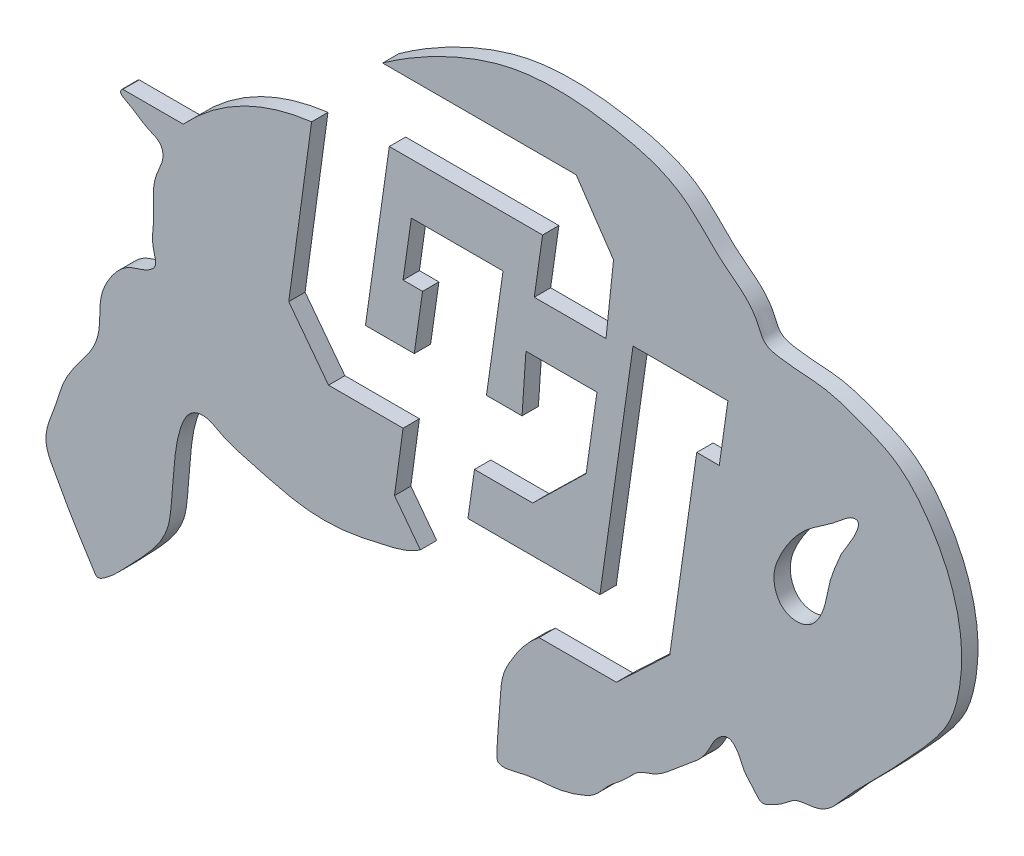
ISO-10303-21;
HEADER;
FILE_DESCRIPTION(('STEP AP214'),'2;1');
FILE_NAME('part.step','',(''),(''),'','','');
FILE_SCHEMA(('AUTOMOTIVE_DESIGN { 1 0 10303 214 1 1 1 1 }'));
ENDSEC;
DATA;
#1=APPLICATION_CONTEXT('core data for automotive mechanical design processes');
#2=APPLICATION_PROTOCOL_DEFINITION('international standard','automotive_design',2000,#1);
#3=PRODUCT_CONTEXT('',#1,'mechanical');
#4=PRODUCT('Part','Part','',(#3));
#5=PRODUCT_RELATED_PRODUCT_CATEGORY('part','',(#4));
#6=PRODUCT_DEFINITION_FORMATION('','',#4);
#7=PRODUCT_DEFINITION_CONTEXT('part definition',#1,'design');
#8=PRODUCT_DEFINITION('design','',#6,#7);
#9=PRODUCT_DEFINITION_SHAPE('','',#8);
#10=(LENGTH_UNIT() NAMED_UNIT(*) SI_UNIT(.MILLI.,.METRE.));
#11=(NAMED_UNIT(*) PLANE_ANGLE_UNIT() SI_UNIT($,.RADIAN.));
#12=(NAMED_UNIT(*) SI_UNIT($,.STERADIAN.) SOLID_ANGLE_UNIT());
#13=UNCERTAINTY_MEASURE_WITH_UNIT(LENGTH_MEASURE(1.E-05),#10,'distance_accuracy_value','');
#14=(GEOMETRIC_REPRESENTATION_CONTEXT(3) GLOBAL_UNCERTAINTY_ASSIGNED_CONTEXT((#13)) GLOBAL_UNIT_ASSIGNED_CONTEXT((#10,
#11,#12)) REPRESENTATION_CONTEXT('',''));
#15=CARTESIAN_POINT('',(0.,0.,0.));
#16=DIRECTION('',(0.,0.,1.));
#17=DIRECTION('',(1.,0.,0.));
#18=AXIS2_PLACEMENT_3D('',#15,#16,#17);
#19=CARTESIAN_POINT('',(68.7324221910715,0.644066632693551,2.54));
#20=DIRECTION('',(0.,0.,-1.));
#21=DIRECTION('',(-1.,0.,0.));
#22=AXIS2_PLACEMENT_3D('',#19,#20,#21);
#23=PLANE('',#22);
#24=DIRECTION('',(-1.,0.,0.));
#25=VECTOR('',#24,1.);
#26=CARTESIAN_POINT('',(2.55683816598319,-7.24989169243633,2.54));
#27=LINE('',#26,#25);
#28=CARTESIAN_POINT('',(2.55683816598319,-7.24989169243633,2.54));
#29=VERTEX_POINT('',#28);
#30=CARTESIAN_POINT('',(-6.48184736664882,-7.24989169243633,2.54));
#31=VERTEX_POINT('',#30);
#32=EDGE_CURVE('E370',#29,#31,#27,.T.);
#33=ORIENTED_EDGE('',*,*,#32,.T.);
#34=DIRECTION('',(-0.14142135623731,-0.989949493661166,0.));
#35=VECTOR('',#34,1.);
#36=CARTESIAN_POINT('',(-6.48184736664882,-7.24989169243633,2.54));
#37=LINE('',#36,#35);
#38=CARTESIAN_POINT('',(-7.49756006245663,-14.359880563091,2.54));
#39=VERTEX_POINT('',#38);
#40=EDGE_CURVE('E175',#31,#39,#37,.T.);
#41=ORIENTED_EDGE('',*,*,#40,.T.);
#42=DIRECTION('',(1.,0.,0.));
#43=VECTOR('',#42,1.);
#44=CARTESIAN_POINT('',(-7.49756006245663,-14.359880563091,2.54));
#45=LINE('',#44,#43);
#46=CARTESIAN_POINT('',(12.9857659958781,-14.359880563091,2.54));
#47=VERTEX_POINT('',#46);
#48=EDGE_CURVE('E475',#39,#47,#45,.T.);
#49=ORIENTED_EDGE('',*,*,#48,.T.);
#50=DIRECTION('',(0.14142135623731,0.989949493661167,0.));
#51=VECTOR('',#50,1.);
#52=CARTESIAN_POINT('',(12.9857659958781,-14.359880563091,2.54));
#53=LINE('',#52,#51);
#54=CARTESIAN_POINT('',(18.1283946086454,21.6385197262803,2.54));
#55=VERTEX_POINT('',#54);
#56=EDGE_CURVE('E495',#47,#55,#53,.T.);
#57=ORIENTED_EDGE('',*,*,#56,.T.);
#58=DIRECTION('',(1.,0.,0.));
#59=VECTOR('',#58,1.);
#60=CARTESIAN_POINT('',(18.1283946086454,21.6385197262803,2.54));
#61=LINE('',#60,#59);
#62=CARTESIAN_POINT('',(32.8500954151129,21.6385197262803,2.54));
#63=VERTEX_POINT('',#62);
#64=EDGE_CURVE('E491',#55,#63,#61,.T.);
#65=ORIENTED_EDGE('',*,*,#64,.T.);
#66=DIRECTION('',(-0.141421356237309,-0.989949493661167,0.));
#67=VECTOR('',#66,1.);
#68=CARTESIAN_POINT('',(32.8500954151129,21.6385197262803,2.54));
#69=LINE('',#68,#67);
#70=CARTESIAN_POINT('',(31.5133181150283,12.2810786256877,2.54));
#71=VERTEX_POINT('',#70);
#72=EDGE_CURVE('E494',#63,#71,#69,.T.);
#73=ORIENTED_EDGE('',*,*,#72,.T.);
#74=DIRECTION('',(-1.,0.,0.));
#75=VECTOR('',#74,1.);
#76=CARTESIAN_POINT('',(31.5133181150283,12.2810786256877,2.54));
#77=LINE('',#76,#75);
#78=CARTESIAN_POINT('',(28.0133170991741,12.2810786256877,2.54));
#79=VERTEX_POINT('',#78);
#80=EDGE_CURVE('E499',#71,#79,#77,.T.);
#81=ORIENTED_EDGE('',*,*,#80,.T.);
#82=DIRECTION('',(-0.141421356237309,-0.989949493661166,0.));
#83=VECTOR('',#82,1.);
#84=CARTESIAN_POINT('',(28.0133170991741,12.2810786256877,2.54));
#85=LINE('',#84,#83);
#86=CARTESIAN_POINT('',(23.8281295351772,-17.0152343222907,2.54));
#87=VERTEX_POINT('',#86);
#88=EDGE_CURVE('E506',#79,#87,#85,.T.);
#89=ORIENTED_EDGE('',*,*,#88,.T.);
#90=DIRECTION('',(-0.726646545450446,-0.687011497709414,0.));
#91=VECTOR('',#90,1.);
#92=CARTESIAN_POINT('',(23.8281295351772,-17.0152343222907,2.54));
#93=LINE('',#92,#91);
#94=CARTESIAN_POINT('',(15.5496568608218,-24.8421564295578,2.54));
#95=VERTEX_POINT('',#94);
#96=EDGE_CURVE('E509',#87,#95,#93,.T.);
#97=ORIENTED_EDGE('',*,*,#96,.T.);
#98=DIRECTION('',(-1.,0.,0.));
#99=VECTOR('',#98,1.);
#100=CARTESIAN_POINT('',(15.5496568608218,-24.8421564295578,2.54));
#101=LINE('',#100,#99);
#102=CARTESIAN_POINT('',(3.53992143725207,-24.8421564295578,2.54));
#103=VERTEX_POINT('',#102);
#104=EDGE_CURVE('E512',#95,#103,#101,.T.);
#105=ORIENTED_EDGE('',*,*,#104,.T.);
#106=CARTESIAN_POINT('',(3.53992143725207,-24.8421564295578,2.54));
#107=CARTESIAN_POINT('',(3.05816558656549,-25.2194081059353,2.54));
#108=CARTESIAN_POINT('',(2.14454622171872,-26.0442564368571,2.54));
#109=CARTESIAN_POINT('',(0.946363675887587,-27.4220207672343,2.54));
#110=CARTESIAN_POINT('',(-0.117663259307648,-28.9205443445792,2.54));
#111=CARTESIAN_POINT('',(-1.08838798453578,-30.5101378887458,2.54));
#112=CARTESIAN_POINT('',(-1.92825100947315,-32.1437927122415,2.54));
#113=CARTESIAN_POINT('',(-2.33810951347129,-33.8906254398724,2.54));
#114=CARTESIAN_POINT('',(-2.48898505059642,-35.7417513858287,2.54));
#115=CARTESIAN_POINT('',(-2.58881179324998,-37.6303757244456,2.54));
#116=CARTESIAN_POINT('',(-2.73965248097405,-39.4946785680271,2.54));
#117=CARTESIAN_POINT('',(-2.8621567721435,-41.0211322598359,2.54));
#118=CARTESIAN_POINT('',(-2.94710891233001,-42.2125344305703,2.54));
#119=CARTESIAN_POINT('',(-2.9876785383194,-42.9710495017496,2.54));
#120=CARTESIAN_POINT('',(-3.00883374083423,-43.6157603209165,2.54));
#121=CARTESIAN_POINT('',(-3.0167282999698,-44.1106068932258,2.54));
#122=CARTESIAN_POINT('',(-2.96095373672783,-44.5225558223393,2.54));
#123=CARTESIAN_POINT('',(-2.77966511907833,-44.840260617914,2.54));
#124=CARTESIAN_POINT('',(-2.31857136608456,-45.0430337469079,2.54));
#125=CARTESIAN_POINT('',(-1.04163951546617,-44.9802237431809,2.54));
#126=CARTESIAN_POINT('',(1.0305828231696,-44.3947720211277,2.54));
#127=CARTESIAN_POINT('',(3.10389730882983,-44.0617748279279,2.54));
#128=CARTESIAN_POINT('',(4.8709271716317,-43.9251818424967,2.54));
#129=CARTESIAN_POINT('',(6.51468033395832,-43.7775602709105,2.54));
#130=CARTESIAN_POINT('',(8.25408619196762,-43.3899943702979,2.54));
#131=CARTESIAN_POINT('',(10.0594075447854,-42.7815234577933,2.54));
#132=CARTESIAN_POINT('',(11.7515625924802,-42.0386002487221,2.54));
#133=CARTESIAN_POINT('',(13.0556203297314,-40.841855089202,2.54));
#134=CARTESIAN_POINT('',(14.2613454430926,-39.3641584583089,2.54));
#135=CARTESIAN_POINT('',(15.7310134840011,-38.2000592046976,2.54));
#136=CARTESIAN_POINT('',(17.1424379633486,-37.0478511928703,2.54));
#137=CARTESIAN_POINT('',(18.1480072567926,-35.8172270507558,2.54));
#138=CARTESIAN_POINT('',(19.1968878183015,-35.0878115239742,2.54));
#139=CARTESIAN_POINT('',(20.078047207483,-34.7357241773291,2.54));
#140=CARTESIAN_POINT('',(20.9697679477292,-34.4339809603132,2.54));
#141=CARTESIAN_POINT('',(22.0756993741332,-33.946520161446,2.54));
#142=CARTESIAN_POINT('',(23.328354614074,-33.0668296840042,2.54));
#143=CARTESIAN_POINT('',(24.7113330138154,-31.8446742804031,2.54));
#144=CARTESIAN_POINT('',(26.1498298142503,-30.651961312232,2.54));
#145=CARTESIAN_POINT('',(27.6128443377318,-29.5315723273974,2.54));
#146=CARTESIAN_POINT('',(28.7227949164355,-28.4670304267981,2.54));
#147=CARTESIAN_POINT('',(29.4433580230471,-27.5007245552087,2.54));
#148=CARTESIAN_POINT('',(29.8637745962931,-26.7228761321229,2.54));
#149=CARTESIAN_POINT('',(30.270787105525,-25.9048108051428,2.54));
#150=CARTESIAN_POINT('',(30.7520019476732,-25.0877375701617,2.54));
#151=CARTESIAN_POINT('',(31.4214286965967,-24.2899263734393,2.54));
#152=CARTESIAN_POINT('',(32.1635522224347,-23.7434219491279,2.54));
#153=CARTESIAN_POINT('',(32.8334438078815,-23.6014234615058,2.54));
#154=CARTESIAN_POINT('',(33.5045229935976,-23.7842663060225,2.54));
#155=CARTESIAN_POINT('',(34.1646481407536,-24.425069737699,2.54));
#156=CARTESIAN_POINT('',(34.682681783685,-25.2962346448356,2.54));
#157=CARTESIAN_POINT('',(35.045936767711,-26.1605158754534,2.54));
#158=CARTESIAN_POINT('',(35.4180972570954,-26.9361119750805,2.54));
#159=CARTESIAN_POINT('',(35.9554376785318,-27.5970072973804,2.54));
#160=CARTESIAN_POINT('',(36.6076672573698,-28.2522018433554,2.54));
#161=CARTESIAN_POINT('',(37.2622304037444,-29.0658159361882,2.54));
#162=CARTESIAN_POINT('',(37.7701949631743,-29.6516198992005,2.54));
#163=CARTESIAN_POINT('',(38.1734308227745,-29.7679097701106,2.54));
#164=CARTESIAN_POINT('',(38.6931573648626,-29.7078172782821,2.54));
#165=CARTESIAN_POINT('',(39.4704974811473,-29.338060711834,2.54));
#166=CARTESIAN_POINT('',(40.3364331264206,-28.8816914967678,2.54));
#167=CARTESIAN_POINT('',(41.1001663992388,-28.4419777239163,2.54));
#168=CARTESIAN_POINT('',(41.8083721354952,-27.9187594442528,2.54));
#169=CARTESIAN_POINT('',(42.5312869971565,-27.2967525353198,2.54));
#170=CARTESIAN_POINT('',(43.3640655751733,-26.782877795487,2.54));
#171=CARTESIAN_POINT('',(44.3103519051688,-26.5587327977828,2.54));
#172=CARTESIAN_POINT('',(45.5716170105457,-26.4056502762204,2.54));
#173=CARTESIAN_POINT('',(47.071771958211,-26.2082775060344,2.54));
#174=CARTESIAN_POINT('',(48.6473592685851,-25.2924818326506,2.54));
#175=CARTESIAN_POINT('',(49.9317576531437,-23.9800506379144,2.54));
#176=CARTESIAN_POINT('',(51.0988972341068,-22.5388366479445,2.54));
#177=CARTESIAN_POINT('',(52.3573234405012,-21.1664888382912,2.54));
#178=CARTESIAN_POINT('',(54.0820547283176,-19.3899053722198,2.54));
#179=CARTESIAN_POINT('',(56.2972022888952,-17.2305943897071,2.54));
#180=CARTESIAN_POINT('',(58.84930973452,-14.5522278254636,2.54));
#181=CARTESIAN_POINT('',(61.3777483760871,-11.839952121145,2.54));
#182=CARTESIAN_POINT('',(63.859967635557,-9.10764568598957,2.54));
#183=CARTESIAN_POINT('',(65.8150582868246,-6.69948715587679,2.54));
#184=CARTESIAN_POINT('',(67.0973025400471,-4.61966239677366,2.54));
#185=CARTESIAN_POINT('',(68.0741109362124,-2.3855814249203,2.54));
#186=CARTESIAN_POINT('',(68.8144123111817,0.634301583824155,2.54));
#187=CARTESIAN_POINT('',(69.2108332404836,4.31675148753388,2.54));
#188=CARTESIAN_POINT('',(69.0362128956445,9.22760016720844,2.54));
#189=CARTESIAN_POINT('',(67.7773821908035,14.0630980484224,2.54));
#190=CARTESIAN_POINT('',(65.669756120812,18.5170375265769,2.54));
#191=CARTESIAN_POINT('',(63.6819154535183,21.6342644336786,2.54));
#192=CARTESIAN_POINT('',(61.3422330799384,24.561808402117,2.54));
#193=CARTESIAN_POINT('',(58.5301952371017,26.8818183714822,2.54));
#194=CARTESIAN_POINT('',(55.7360583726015,28.1789827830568,2.54));
#195=CARTESIAN_POINT('',(53.4026832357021,29.0880677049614,2.54));
#196=CARTESIAN_POINT('',(51.0558399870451,29.9608581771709,2.54));
#197=CARTESIAN_POINT('',(48.7047909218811,30.6645888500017,2.54));
#198=CARTESIAN_POINT('',(46.3423615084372,30.9685783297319,2.54));
#199=CARTESIAN_POINT('',(44.5353789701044,31.0910519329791,2.54));
#200=CARTESIAN_POINT('',(42.6790963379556,31.216031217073,2.54));
#201=CARTESIAN_POINT('',(41.0847549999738,31.4098101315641,2.54));
#202=CARTESIAN_POINT('',(39.7595452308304,31.6749650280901,2.54));
#203=CARTESIAN_POINT('',(38.8339963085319,32.0376511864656,2.54));
#204=CARTESIAN_POINT('',(38.1670196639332,32.7558362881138,2.54));
#205=CARTESIAN_POINT('',(37.7919867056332,33.6661770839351,2.54));
#206=CARTESIAN_POINT('',(37.4076128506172,34.5245698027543,2.54));
#207=CARTESIAN_POINT('',(36.7824707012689,35.580063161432,2.54));
#208=CARTESIAN_POINT('',(35.8399453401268,36.7549801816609,2.54));
#209=CARTESIAN_POINT('',(34.4759301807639,37.9574459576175,2.54));
#210=CARTESIAN_POINT('',(32.9940657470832,39.0789349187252,2.54));
#211=CARTESIAN_POINT('',(31.5267266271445,40.2618226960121,2.54));
#212=CARTESIAN_POINT('',(29.7241246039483,42.0023237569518,2.54));
#213=CARTESIAN_POINT('',(28.0069462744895,43.7969661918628,2.54));
#214=CARTESIAN_POINT('',(26.1628557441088,45.362058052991,2.54));
#215=CARTESIAN_POINT('',(24.152537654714,46.6814148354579,2.54));
#216=CARTESIAN_POINT('',(21.3592247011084,47.9293126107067,2.54));
#217=CARTESIAN_POINT('',(17.7218505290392,48.9348934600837,2.54));
#218=CARTESIAN_POINT('',(13.9664406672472,49.6195536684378,2.54));
#219=CARTESIAN_POINT('',(10.2360037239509,50.0958610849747,2.54));
#220=CARTESIAN_POINT('',(5.29185079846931,50.3564673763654,2.54));
#221=CARTESIAN_POINT('',(-0.795970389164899,49.8389943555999,2.54));
#222=CARTESIAN_POINT('',(-7.89355359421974,47.5337810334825,2.54));
#223=CARTESIAN_POINT('',(-14.5679616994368,44.3236497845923,2.54));
#224=CARTESIAN_POINT('',(-18.7347065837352,41.6692513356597,2.54));
#225=CARTESIAN_POINT('',(-20.7439903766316,40.2431151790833,2.54));
#226=B_SPLINE_CURVE_WITH_KNOTS('',3,(#106,#107,#108,#109,#110,#111,#112,#113,#114,#115,#116,
#117,#118,#119,#120,#121,#122,#123,#124,#125,#126,#127,#128,#129,#130,#131,#132,#133,#134,#135,
#136,#137,#138,#139,#140,#141,#142,#143,#144,#145,#146,#147,#148,#149,#150,#151,#152,#153,#154,
#155,#156,#157,#158,#159,#160,#161,#162,#163,#164,#165,#166,#167,#168,#169,#170,#171,#172,#173,
#174,#175,#176,#177,#178,#179,#180,#181,#182,#183,#184,#185,#186,#187,#188,#189,#190,#191,#192,
#193,#194,#195,#196,#197,#198,#199,#200,#201,#202,#203,#204,#205,#206,#207,#208,#209,#210,#211,
#212,#213,#214,#215,#216,#217,#218,#219,#220,#221,#222,#223,#224,#225),.UNSPECIFIED.,.F.,.F.,(4,
1,1,1,1,1,1,1,1,1,1,1,1,1,1,1,1,1,1,1,1,1,1,1,1,1,1,1,1,1,1,1,1,1,1,1,1,1,1,1,1,1,1,1,1,1,1,1,1,
1,1,1,1,1,1,1,1,1,1,1,1,1,1,1,1,1,1,1,1,1,1,1,1,1,1,1,1,1,1,1,1,1,1,1,1,1,1,1,1,1,1,1,1,1,1,1,1,
1,1,1,1,1,1,1,1,1,1,1,1,1,1,1,1,1,1,1,1,4),(0.00233193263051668,0.010124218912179,
0.0179165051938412,0.0257087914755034,0.0335010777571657,0.041293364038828,0.0490856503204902,
0.0568779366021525,0.0646702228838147,0.072462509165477,0.0802547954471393,0.0841509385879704,
0.0880470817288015,0.089995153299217,0.0919432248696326,0.0938912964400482,0.0958393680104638,
0.099735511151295,0.103631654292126,0.111423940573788,0.119216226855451,0.127008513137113,
0.134800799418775,0.142593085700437,0.1503853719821,0.158177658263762,0.165969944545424,
0.173762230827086,0.181554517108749,0.189346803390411,0.197139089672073,0.201035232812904,
0.204931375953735,0.208827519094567,0.212723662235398,0.22051594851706,0.228308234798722,
0.236100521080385,0.243892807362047,0.251685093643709,0.25558123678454,0.259477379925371,
0.263373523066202,0.267269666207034,0.271165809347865,0.275061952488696,0.277010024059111,
0.278958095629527,0.282854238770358,0.286750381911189,0.29064652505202,0.294542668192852,
0.298438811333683,0.302334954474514,0.306231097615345,0.310127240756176,0.312075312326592,
0.314023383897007,0.317919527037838,0.32181567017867,0.325711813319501,0.329607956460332,
0.333504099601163,0.337400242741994,0.341296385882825,0.345192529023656,0.352984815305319,
0.360777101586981,0.368569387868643,0.376361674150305,0.384153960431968,0.39194624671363,
0.407530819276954,0.423115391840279,0.438699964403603,0.454284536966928,0.469869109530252,
0.477661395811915,0.485453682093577,0.501038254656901,0.516622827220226,0.53220739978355,
0.5633765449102,0.578961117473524,0.594545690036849,0.610130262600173,0.625714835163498,
0.641299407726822,0.649091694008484,0.656883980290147,0.672468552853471,0.680260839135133,
0.688053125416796,0.695845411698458,0.70363769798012,0.707533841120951,0.711429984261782,
0.715326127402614,0.719222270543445,0.723118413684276,0.727014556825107,0.734806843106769,
0.742599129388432,0.750391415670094,0.758183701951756,0.765975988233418,0.781560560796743,
0.789352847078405,0.797145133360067,0.812729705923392,0.828314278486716,0.843898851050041,
0.859483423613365,0.87506799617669,0.906237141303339,0.937406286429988,0.968575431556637,
0.999744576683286),.UNSPECIFIED.);
#227=CARTESIAN_POINT('',(-20.7439903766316,40.2431151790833,2.54));
#228=VERTEX_POINT('',#227);
#229=EDGE_CURVE('E515',#103,#228,#226,.T.);
#230=ORIENTED_EDGE('',*,*,#229,.T.);
#231=DIRECTION('',(1.,0.,0.));
#232=VECTOR('',#231,1.);
#233=CARTESIAN_POINT('',(9.29823085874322,40.2431151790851,2.54));
#234=LINE('',#233,#232);
#235=CARTESIAN_POINT('',(9.29823085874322,40.2431151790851,2.54));
#236=VERTEX_POINT('',#235);
#237=EDGE_CURVE('E521',#228,#236,#234,.T.);
#238=ORIENTED_EDGE('',*,*,#237,.T.);
#239=DIRECTION('',(0.562463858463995,-0.826821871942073,0.));
#240=VECTOR('',#239,1.);
#241=CARTESIAN_POINT('',(15.0997559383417,31.7148733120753,2.54));
#242=LINE('',#241,#240);
#243=CARTESIAN_POINT('',(15.0997559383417,31.7148733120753,2.54));
#244=VERTEX_POINT('',#243);
#245=EDGE_CURVE('E934',#236,#244,#242,.T.);
#246=ORIENTED_EDGE('',*,*,#245,.T.);
#247=DIRECTION('',(-0.103682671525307,-0.994610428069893,0.));
#248=VECTOR('',#247,1.);
#249=CARTESIAN_POINT('',(13.9339950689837,20.5319253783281,2.54));
#250=LINE('',#249,#248);
#251=CARTESIAN_POINT('',(13.9339950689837,20.5319253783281,2.54));
#252=VERTEX_POINT('',#251);
#253=EDGE_CURVE('E648',#244,#252,#250,.T.);
#254=ORIENTED_EDGE('',*,*,#253,.T.);
#255=DIRECTION('',(-1.,0.,0.));
#256=VECTOR('',#255,1.);
#257=CARTESIAN_POINT('',(2.79917930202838,20.5319253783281,2.54));
#258=LINE('',#257,#256);
#259=CARTESIAN_POINT('',(2.79917930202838,20.5319253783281,2.54));
#260=VERTEX_POINT('',#259);
#261=EDGE_CURVE('E660',#252,#260,#258,.T.);
#262=ORIENTED_EDGE('',*,*,#261,.T.);
#263=DIRECTION('',(0.14142135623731,0.989949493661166,0.));
#264=VECTOR('',#263,1.);
#265=CARTESIAN_POINT('',(4.0867927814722,29.5452197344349,2.54));
#266=LINE('',#265,#264);
#267=CARTESIAN_POINT('',(4.0867927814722,29.5452197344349,2.54));
#268=VERTEX_POINT('',#267);
#269=EDGE_CURVE('E656',#260,#268,#266,.T.);
#270=ORIENTED_EDGE('',*,*,#269,.T.);
#271=DIRECTION('',(-1.,0.,0.));
#272=VECTOR('',#271,1.);
#273=CARTESIAN_POINT('',(-19.7013765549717,29.5452197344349,2.54));
#274=LINE('',#273,#272);
#275=CARTESIAN_POINT('',(-19.7013765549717,29.5452197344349,2.54));
#276=VERTEX_POINT('',#275);
#277=EDGE_CURVE('E659',#268,#276,#274,.T.);
#278=ORIENTED_EDGE('',*,*,#277,.T.);
#279=DIRECTION('',(-0.141421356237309,-0.989949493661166,0.));
#280=VECTOR('',#279,1.);
#281=CARTESIAN_POINT('',(-19.7013765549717,29.5452197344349,2.54));
#282=LINE('',#281,#280);
#283=CARTESIAN_POINT('',(-23.4019941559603,3.64089652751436,2.54));
#284=VERTEX_POINT('',#283);
#285=EDGE_CURVE('E664',#276,#284,#282,.T.);
#286=ORIENTED_EDGE('',*,*,#285,.T.);
#287=DIRECTION('',(1.,0.,0.));
#288=VECTOR('',#287,1.);
#289=CARTESIAN_POINT('',(-23.4019941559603,3.64089652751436,2.54));
#290=LINE('',#289,#288);
#291=CARTESIAN_POINT('',(-15.8255133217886,3.64089652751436,2.54));
#292=VERTEX_POINT('',#291);
#293=EDGE_CURVE('E671',#284,#292,#290,.T.);
#294=ORIENTED_EDGE('',*,*,#293,.T.);
#295=DIRECTION('',(0.14142135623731,0.989949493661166,0.));
#296=VECTOR('',#295,1.);
#297=CARTESIAN_POINT('',(-15.8255133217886,3.64089652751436,2.54));
#298=LINE('',#297,#296);
#299=CARTESIAN_POINT('',(-14.5373458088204,12.6580691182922,2.54));
#300=VERTEX_POINT('',#299);
#301=EDGE_CURVE('E674',#292,#300,#298,.T.);
#302=ORIENTED_EDGE('',*,*,#301,.T.);
#303=DIRECTION('',(-1.,0.,0.));
#304=VECTOR('',#303,1.);
#305=CARTESIAN_POINT('',(-14.5373458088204,12.6580691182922,2.54));
#306=LINE('',#305,#304);
#307=CARTESIAN_POINT('',(-17.5635928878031,12.6580691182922,2.54));
#308=VERTEX_POINT('',#307);
#309=EDGE_CURVE('E677',#300,#308,#306,.T.);
#310=ORIENTED_EDGE('',*,*,#309,.T.);
#311=DIRECTION('',(0.14142135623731,0.989949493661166,0.));
#312=VECTOR('',#311,1.);
#313=CARTESIAN_POINT('',(-17.5635928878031,12.6580691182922,2.54));
#314=LINE('',#313,#312);
#315=CARTESIAN_POINT('',(-16.2806713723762,21.6385197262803,2.54));
#316=VERTEX_POINT('',#315);
#317=EDGE_CURVE('E680',#308,#316,#314,.T.);
#318=ORIENTED_EDGE('',*,*,#317,.T.);
#319=DIRECTION('',(1.,0.,0.));
#320=VECTOR('',#319,1.);
#321=CARTESIAN_POINT('',(-16.2806713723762,21.6385197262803,2.54));
#322=LINE('',#321,#320);
#323=CARTESIAN_POINT('',(-2.04777088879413,21.6385197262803,2.54));
#324=VERTEX_POINT('',#323);
#325=EDGE_CURVE('E683',#316,#324,#322,.T.);
#326=ORIENTED_EDGE('',*,*,#325,.T.);
#327=DIRECTION('',(-0.14142135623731,-0.989949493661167,0.));
#328=VECTOR('',#327,1.);
#329=CARTESIAN_POINT('',(-2.04777088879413,21.6385197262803,2.54));
#330=LINE('',#329,#328);
#331=CARTESIAN_POINT('',(-4.61972548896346,3.63483752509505,2.54));
#332=VERTEX_POINT('',#331);
#333=EDGE_CURVE('E686',#324,#332,#330,.T.);
#334=ORIENTED_EDGE('',*,*,#333,.T.);
#335=DIRECTION('',(1.,0.,0.));
#336=VECTOR('',#335,1.);
#337=CARTESIAN_POINT('',(-4.61972548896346,3.63483752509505,2.54));
#338=LINE('',#337,#336);
#339=CARTESIAN_POINT('',(0.901703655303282,3.63483752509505,2.54));
#340=VERTEX_POINT('',#339);
#341=EDGE_CURVE('E689',#332,#340,#338,.T.);
#342=ORIENTED_EDGE('',*,*,#341,.T.);
#343=DIRECTION('',(0.0669142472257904,0.997758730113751,0.));
#344=VECTOR('',#343,1.);
#345=CARTESIAN_POINT('',(0.901703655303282,3.63483752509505,2.54));
#346=LINE('',#345,#344);
#347=CARTESIAN_POINT('',(1.50540814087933,12.6366786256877,2.54));
#348=VERTEX_POINT('',#347);
#349=EDGE_CURVE('E257',#340,#348,#346,.T.);
#350=ORIENTED_EDGE('',*,*,#349,.T.);
#351=DIRECTION('',(1.,0.,0.));
#352=VECTOR('',#351,1.);
#353=CARTESIAN_POINT('',(1.50540814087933,12.6366786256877,2.54));
#354=LINE('',#353,#352);
#355=CARTESIAN_POINT('',(12.5322629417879,12.6366786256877,2.54));
#356=VERTEX_POINT('',#355);
#357=EDGE_CURVE('E251',#348,#356,#354,.T.);
#358=ORIENTED_EDGE('',*,*,#357,.T.);
#359=DIRECTION('',(-0.14142135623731,-0.989949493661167,0.));
#360=VECTOR('',#359,1.);
#361=CARTESIAN_POINT('',(12.5322629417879,12.6366786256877,2.54));
#362=LINE('',#361,#360);
#363=CARTESIAN_POINT('',(10.848697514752,0.851720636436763,2.54));
#364=VERTEX_POINT('',#363);
#365=EDGE_CURVE('E255',#356,#364,#362,.T.);
#366=ORIENTED_EDGE('',*,*,#365,.T.);
#367=DIRECTION('',(-0.715264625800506,-0.6988537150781,0.));
#368=VECTOR('',#367,1.);
#369=CARTESIAN_POINT('',(10.848697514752,0.851720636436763,2.54));
#370=LINE('',#369,#368);
#371=EDGE_CURVE('E69',#364,#29,#370,.T.);
#372=ORIENTED_EDGE('',*,*,#371,.T.);
#373=EDGE_LOOP('',(#33,#41,#49,#57,#65,#73,#81,#89,#97,#105,#230,#238,#246,#254,#262,#270,#278,
#286,#294,#302,#310,#318,#326,#334,#342,#350,#358,#366,#372));
#374=FACE_BOUND('',#373,.T.);
#375=CARTESIAN_POINT('',(52.8173403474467,15.617590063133,2.54));
#376=CARTESIAN_POINT('',(52.7607430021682,15.6288132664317,2.54));
#377=CARTESIAN_POINT('',(52.6653075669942,15.6417937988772,2.54));
#378=CARTESIAN_POINT('',(52.4520052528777,15.6357012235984,2.54));
#379=CARTESIAN_POINT('',(52.1911574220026,15.5751718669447,2.54));
#380=CARTESIAN_POINT('',(51.8726612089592,15.4385927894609,2.54));
#381=CARTESIAN_POINT('',(51.4421542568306,15.1889619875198,2.54));
#382=CARTESIAN_POINT('',(50.8896295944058,14.7787407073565,2.54));
#383=CARTESIAN_POINT('',(50.2155583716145,14.2104119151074,2.54));
#384=CARTESIAN_POINT('',(49.5566689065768,13.6603162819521,2.54));
#385=CARTESIAN_POINT('',(48.7065949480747,13.0092804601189,2.54));
#386=CARTESIAN_POINT('',(47.6881934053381,12.297257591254,2.54));
#387=CARTESIAN_POINT('',(46.5322233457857,11.5211417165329,2.54));
#388=CARTESIAN_POINT('',(45.4372514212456,10.7327603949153,2.54));
#389=CARTESIAN_POINT('',(44.3996468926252,9.83055248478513,2.54));
#390=CARTESIAN_POINT('',(43.1072129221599,8.42031422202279,2.54));
#391=CARTESIAN_POINT('',(41.9666620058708,6.77934682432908,2.54));
#392=CARTESIAN_POINT('',(40.9944050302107,5.02756039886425,2.54));
#393=CARTESIAN_POINT('',(40.3761267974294,3.66405147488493,2.54));
#394=CARTESIAN_POINT('',(39.9958349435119,2.23155302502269,2.54));
#395=CARTESIAN_POINT('',(39.9763545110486,0.193500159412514,2.54));
#396=CARTESIAN_POINT('',(41.1038537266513,-2.42159111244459,2.54));
#397=CARTESIAN_POINT('',(44.0562100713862,-2.92342699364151,2.54));
#398=CARTESIAN_POINT('',(45.9130514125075,-1.94864527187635,2.54));
#399=CARTESIAN_POINT('',(46.9028894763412,-0.742711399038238,2.54));
#400=CARTESIAN_POINT('',(47.5806868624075,0.638459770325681,2.54));
#401=CARTESIAN_POINT('',(47.9936069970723,1.99808785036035,2.54));
#402=CARTESIAN_POINT('',(48.2787199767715,3.37407009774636,2.54));
#403=CARTESIAN_POINT('',(48.5554286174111,4.77946480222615,2.54));
#404=CARTESIAN_POINT('',(48.9591305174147,6.24983254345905,2.54));
#405=CARTESIAN_POINT('',(49.5630992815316,7.77820435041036,2.54));
#406=CARTESIAN_POINT('',(50.1202566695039,9.04494682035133,2.54));
#407=CARTESIAN_POINT('',(50.3698946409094,9.68796258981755,2.54));
#408=CARTESIAN_POINT('',(50.6186315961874,10.173829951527,2.54));
#409=CARTESIAN_POINT('',(51.0878928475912,10.9221021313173,2.54));
#410=CARTESIAN_POINT('',(51.6097310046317,11.726681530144,2.54));
#411=CARTESIAN_POINT('',(52.1887664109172,12.6935305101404,2.54));
#412=CARTESIAN_POINT('',(52.6388799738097,13.5811788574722,2.54));
#413=CARTESIAN_POINT('',(52.9292820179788,14.3086936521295,2.54));
#414=CARTESIAN_POINT('',(53.0715115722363,14.7640398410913,2.54));
#415=CARTESIAN_POINT('',(53.125970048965,15.0876891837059,2.54));
#416=CARTESIAN_POINT('',(53.1247702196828,15.3043395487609,2.54));
#417=CARTESIAN_POINT('',(53.063818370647,15.4898739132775,2.54));
#418=CARTESIAN_POINT('',(52.90667617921,15.598388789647,2.54));
#419=CARTESIAN_POINT('',(52.8456390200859,15.6119784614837,2.54));
#420=CARTESIAN_POINT('',(52.8173403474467,15.617590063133,2.54));
#421=B_SPLINE_CURVE_WITH_KNOTS('',3,(#375,#376,#377,#378,#379,#380,#381,#382,#383,#384,#385,
#386,#387,#388,#389,#390,#391,#392,#393,#394,#395,#396,#397,#398,#399,#400,#401,#402,#403,#404,
#405,#406,#407,#408,#409,#410,#411,#412,#413,#414,#415,#416,#417,#418,#419,#420),.UNSPECIFIED.,
.T.,.F.,(4,1,1,1,1,1,1,1,1,1,1,1,1,1,1,1,1,1,1,1,1,1,1,1,1,1,1,1,1,1,1,1,1,1,1,1,1,1,1,1,1,1,1,
4),(0.,0.00390625,0.0078125,0.015625,0.0234375,0.03125,0.046875,0.0625,0.078125,0.09375,0.125,
0.15625,0.1875,0.21875,0.25,0.3125,0.34375,0.375,0.40625,0.4375,0.5,0.5625,0.59375,0.625,
0.65625,0.6875,0.71875,0.75,0.78125,0.8125,0.84375,0.875,0.90625,0.921875,0.9375,0.953125,
0.96875,0.9765625,0.984375,0.98828125,0.9921875,0.99609375,0.998046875,1.),.UNSPECIFIED.);
#422=CARTESIAN_POINT('',(52.8173403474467,15.617590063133,2.54));
#423=VERTEX_POINT('',#422);
#424=EDGE_CURVE('E284',#423,#423,#421,.T.);
#425=ORIENTED_EDGE('',*,*,#424,.F.);
#426=EDGE_LOOP('',(#425));
#427=FACE_BOUND('',#426,.T.);
#428=ADVANCED_FACE('F51',(#374,#427),#23,.F.);
#429=CARTESIAN_POINT('',(68.7324221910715,0.644066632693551,0.));
#430=DIRECTION('',(0.,0.,-1.));
#431=DIRECTION('',(-1.,0.,0.));
#432=AXIS2_PLACEMENT_3D('',#429,#430,#431);
#433=PLANE('',#432);
#434=DIRECTION('',(-1.,0.,0.));
#435=VECTOR('',#434,1.);
#436=CARTESIAN_POINT('',(2.55683816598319,-7.24989169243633,0.));
#437=LINE('',#436,#435);
#438=CARTESIAN_POINT('',(2.55683816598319,-7.24989169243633,0.));
#439=VERTEX_POINT('',#438);
#440=CARTESIAN_POINT('',(-6.48184736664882,-7.24989169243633,0.));
#441=VERTEX_POINT('',#440);
#442=EDGE_CURVE('E279',#439,#441,#437,.T.);
#443=ORIENTED_EDGE('',*,*,#442,.F.);
#444=DIRECTION('',(-0.715264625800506,-0.6988537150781,0.));
#445=VECTOR('',#444,1.);
#446=CARTESIAN_POINT('',(10.848697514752,0.851720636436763,0.));
#447=LINE('',#446,#445);
#448=CARTESIAN_POINT('',(10.848697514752,0.851720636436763,0.));
#449=VERTEX_POINT('',#448);
#450=EDGE_CURVE('E167',#449,#439,#447,.T.);
#451=ORIENTED_EDGE('',*,*,#450,.F.);
#452=DIRECTION('',(-0.14142135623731,-0.989949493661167,0.));
#453=VECTOR('',#452,1.);
#454=CARTESIAN_POINT('',(12.5322629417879,12.6366786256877,0.));
#455=LINE('',#454,#453);
#456=CARTESIAN_POINT('',(12.5322629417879,12.6366786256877,0.));
#457=VERTEX_POINT('',#456);
#458=EDGE_CURVE('E161',#457,#449,#455,.T.);
#459=ORIENTED_EDGE('',*,*,#458,.F.);
#460=DIRECTION('',(1.,0.,0.));
#461=VECTOR('',#460,1.);
#462=CARTESIAN_POINT('',(1.50540814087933,12.6366786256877,0.));
#463=LINE('',#462,#461);
#464=CARTESIAN_POINT('',(1.50540814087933,12.6366786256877,0.));
#465=VERTEX_POINT('',#464);
#466=EDGE_CURVE('E266',#465,#457,#463,.T.);
#467=ORIENTED_EDGE('',*,*,#466,.F.);
#468=DIRECTION('',(0.0669142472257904,0.997758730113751,0.));
#469=VECTOR('',#468,1.);
#470=CARTESIAN_POINT('',(0.901703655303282,3.63483752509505,0.));
#471=LINE('',#470,#469);
#472=CARTESIAN_POINT('',(0.901703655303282,3.63483752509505,0.));
#473=VERTEX_POINT('',#472);
#474=EDGE_CURVE('E361',#473,#465,#471,.T.);
#475=ORIENTED_EDGE('',*,*,#474,.F.);
#476=DIRECTION('',(1.,0.,0.));
#477=VECTOR('',#476,1.);
#478=CARTESIAN_POINT('',(-4.61972548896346,3.63483752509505,0.));
#479=LINE('',#478,#477);
#480=CARTESIAN_POINT('',(-4.61972548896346,3.63483752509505,0.));
#481=VERTEX_POINT('',#480);
#482=EDGE_CURVE('E358',#481,#473,#479,.T.);
#483=ORIENTED_EDGE('',*,*,#482,.F.);
#484=DIRECTION('',(-0.14142135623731,-0.989949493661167,0.));
#485=VECTOR('',#484,1.);
#486=CARTESIAN_POINT('',(-2.04777088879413,21.6385197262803,0.));
#487=LINE('',#486,#485);
#488=CARTESIAN_POINT('',(-2.04777088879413,21.6385197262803,0.));
#489=VERTEX_POINT('',#488);
#490=EDGE_CURVE('E355',#489,#481,#487,.T.);
#491=ORIENTED_EDGE('',*,*,#490,.F.);
#492=DIRECTION('',(1.,0.,0.));
#493=VECTOR('',#492,1.);
#494=CARTESIAN_POINT('',(-16.2806713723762,21.6385197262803,0.));
#495=LINE('',#494,#493);
#496=CARTESIAN_POINT('',(-16.2806713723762,21.6385197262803,0.));
#497=VERTEX_POINT('',#496);
#498=EDGE_CURVE('E352',#497,#489,#495,.T.);
#499=ORIENTED_EDGE('',*,*,#498,.F.);
#500=DIRECTION('',(0.14142135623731,0.989949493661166,0.));
#501=VECTOR('',#500,1.);
#502=CARTESIAN_POINT('',(-17.5635928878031,12.6580691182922,0.));
#503=LINE('',#502,#501);
#504=CARTESIAN_POINT('',(-17.5635928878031,12.6580691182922,0.));
#505=VERTEX_POINT('',#504);
#506=EDGE_CURVE('E349',#505,#497,#503,.T.);
#507=ORIENTED_EDGE('',*,*,#506,.F.);
#508=DIRECTION('',(-1.,0.,0.));
#509=VECTOR('',#508,1.);
#510=CARTESIAN_POINT('',(-14.5373458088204,12.6580691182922,0.));
#511=LINE('',#510,#509);
#512=CARTESIAN_POINT('',(-14.5373458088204,12.6580691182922,0.));
#513=VERTEX_POINT('',#512);
#514=EDGE_CURVE('E346',#513,#505,#511,.T.);
#515=ORIENTED_EDGE('',*,*,#514,.F.);
#516=DIRECTION('',(0.14142135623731,0.989949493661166,0.));
#517=VECTOR('',#516,1.);
#518=CARTESIAN_POINT('',(-15.8255133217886,3.64089652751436,0.));
#519=LINE('',#518,#517);
#520=CARTESIAN_POINT('',(-15.8255133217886,3.64089652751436,0.));
#521=VERTEX_POINT('',#520);
#522=EDGE_CURVE('E343',#521,#513,#519,.T.);
#523=ORIENTED_EDGE('',*,*,#522,.F.);
#524=DIRECTION('',(1.,0.,0.));
#525=VECTOR('',#524,1.);
#526=CARTESIAN_POINT('',(-23.4019941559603,3.64089652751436,0.));
#527=LINE('',#526,#525);
#528=CARTESIAN_POINT('',(-23.4019941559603,3.64089652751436,0.));
#529=VERTEX_POINT('',#528);
#530=EDGE_CURVE('E340',#529,#521,#527,.T.);
#531=ORIENTED_EDGE('',*,*,#530,.F.);
#532=DIRECTION('',(-0.141421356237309,-0.989949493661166,0.));
#533=VECTOR('',#532,1.);
#534=CARTESIAN_POINT('',(-19.7013765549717,29.5452197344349,0.));
#535=LINE('',#534,#533);
#536=CARTESIAN_POINT('',(-19.7013765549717,29.5452197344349,0.));
#537=VERTEX_POINT('',#536);
#538=EDGE_CURVE('E337',#537,#529,#535,.T.);
#539=ORIENTED_EDGE('',*,*,#538,.F.);
#540=DIRECTION('',(-1.,0.,0.));
#541=VECTOR('',#540,1.);
#542=CARTESIAN_POINT('',(-19.7013765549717,29.5452197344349,0.));
#543=LINE('',#542,#541);
#544=CARTESIAN_POINT('',(4.0867927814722,29.5452197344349,0.));
#545=VERTEX_POINT('',#544);
#546=EDGE_CURVE('E334',#545,#537,#543,.T.);
#547=ORIENTED_EDGE('',*,*,#546,.F.);
#548=DIRECTION('',(0.14142135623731,0.989949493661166,0.));
#549=VECTOR('',#548,1.);
#550=CARTESIAN_POINT('',(4.0867927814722,29.5452197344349,0.));
#551=LINE('',#550,#549);
#552=CARTESIAN_POINT('',(2.79917930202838,20.5319253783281,0.));
#553=VERTEX_POINT('',#552);
#554=EDGE_CURVE('E331',#553,#545,#551,.T.);
#555=ORIENTED_EDGE('',*,*,#554,.F.);
#556=DIRECTION('',(-1.,0.,0.));
#557=VECTOR('',#556,1.);
#558=CARTESIAN_POINT('',(2.79917930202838,20.5319253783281,0.));
#559=LINE('',#558,#557);
#560=CARTESIAN_POINT('',(13.9339950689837,20.5319253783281,0.));
#561=VERTEX_POINT('',#560);
#562=EDGE_CURVE('E328',#561,#553,#559,.T.);
#563=ORIENTED_EDGE('',*,*,#562,.F.);
#564=DIRECTION('',(-0.103682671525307,-0.994610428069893,0.));
#565=VECTOR('',#564,1.);
#566=CARTESIAN_POINT('',(13.9339950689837,20.5319253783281,0.));
#567=LINE('',#566,#565);
#568=CARTESIAN_POINT('',(15.0997559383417,31.7148733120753,0.));
#569=VERTEX_POINT('',#568);
#570=EDGE_CURVE('E325',#569,#561,#567,.T.);
#571=ORIENTED_EDGE('',*,*,#570,.F.);
#572=DIRECTION('',(0.562463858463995,-0.826821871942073,0.));
#573=VECTOR('',#572,1.);
#574=CARTESIAN_POINT('',(15.0997559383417,31.7148733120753,0.));
#575=LINE('',#574,#573);
#576=CARTESIAN_POINT('',(9.29823085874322,40.2431151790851,0.));
#577=VERTEX_POINT('',#576);
#578=EDGE_CURVE('E322',#577,#569,#575,.T.);
#579=ORIENTED_EDGE('',*,*,#578,.F.);
#580=DIRECTION('',(1.,0.,0.));
#581=VECTOR('',#580,1.);
#582=CARTESIAN_POINT('',(9.29823085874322,40.2431151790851,0.));
#583=LINE('',#582,#581);
#584=CARTESIAN_POINT('',(-20.7439903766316,40.2431151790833,0.));
#585=VERTEX_POINT('',#584);
#586=EDGE_CURVE('E316',#585,#577,#583,.T.);
#587=ORIENTED_EDGE('',*,*,#586,.F.);
#588=CARTESIAN_POINT('',(3.53992143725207,-24.8421564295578,0.));
#589=CARTESIAN_POINT('',(3.05816558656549,-25.2194081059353,0.));
#590=CARTESIAN_POINT('',(2.14454622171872,-26.0442564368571,0.));
#591=CARTESIAN_POINT('',(0.946363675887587,-27.4220207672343,0.));
#592=CARTESIAN_POINT('',(-0.117663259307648,-28.9205443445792,0.));
#593=CARTESIAN_POINT('',(-1.08838798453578,-30.5101378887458,0.));
#594=CARTESIAN_POINT('',(-1.92825100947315,-32.1437927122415,0.));
#595=CARTESIAN_POINT('',(-2.33810951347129,-33.8906254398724,0.));
#596=CARTESIAN_POINT('',(-2.48898505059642,-35.7417513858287,0.));
#597=CARTESIAN_POINT('',(-2.58881179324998,-37.6303757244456,0.));
#598=CARTESIAN_POINT('',(-2.73965248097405,-39.4946785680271,0.));
#599=CARTESIAN_POINT('',(-2.8621567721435,-41.0211322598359,0.));
#600=CARTESIAN_POINT('',(-2.94710891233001,-42.2125344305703,0.));
#601=CARTESIAN_POINT('',(-2.9876785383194,-42.9710495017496,0.));
#602=CARTESIAN_POINT('',(-3.00883374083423,-43.6157603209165,0.));
#603=CARTESIAN_POINT('',(-3.0167282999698,-44.1106068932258,0.));
#604=CARTESIAN_POINT('',(-2.96095373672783,-44.5225558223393,0.));
#605=CARTESIAN_POINT('',(-2.77966511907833,-44.840260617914,0.));
#606=CARTESIAN_POINT('',(-2.31857136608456,-45.0430337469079,0.));
#607=CARTESIAN_POINT('',(-1.04163951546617,-44.9802237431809,0.));
#608=CARTESIAN_POINT('',(1.0305828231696,-44.3947720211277,0.));
#609=CARTESIAN_POINT('',(3.10389730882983,-44.0617748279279,0.));
#610=CARTESIAN_POINT('',(4.8709271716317,-43.9251818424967,0.));
#611=CARTESIAN_POINT('',(6.51468033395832,-43.7775602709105,0.));
#612=CARTESIAN_POINT('',(8.25408619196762,-43.3899943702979,0.));
#613=CARTESIAN_POINT('',(10.0594075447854,-42.7815234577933,0.));
#614=CARTESIAN_POINT('',(11.7515625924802,-42.0386002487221,0.));
#615=CARTESIAN_POINT('',(13.0556203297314,-40.841855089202,0.));
#616=CARTESIAN_POINT('',(14.2613454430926,-39.3641584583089,0.));
#617=CARTESIAN_POINT('',(15.7310134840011,-38.2000592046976,0.));
#618=CARTESIAN_POINT('',(17.1424379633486,-37.0478511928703,0.));
#619=CARTESIAN_POINT('',(18.1480072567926,-35.8172270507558,0.));
#620=CARTESIAN_POINT('',(19.1968878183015,-35.0878115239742,0.));
#621=CARTESIAN_POINT('',(20.078047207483,-34.7357241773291,0.));
#622=CARTESIAN_POINT('',(20.9697679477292,-34.4339809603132,0.));
#623=CARTESIAN_POINT('',(22.0756993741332,-33.946520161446,0.));
#624=CARTESIAN_POINT('',(23.328354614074,-33.0668296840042,0.));
#625=CARTESIAN_POINT('',(24.7113330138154,-31.8446742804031,0.));
#626=CARTESIAN_POINT('',(26.1498298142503,-30.651961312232,0.));
#627=CARTESIAN_POINT('',(27.6128443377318,-29.5315723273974,0.));
#628=CARTESIAN_POINT('',(28.7227949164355,-28.4670304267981,0.));
#629=CARTESIAN_POINT('',(29.4433580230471,-27.5007245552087,0.));
#630=CARTESIAN_POINT('',(29.8637745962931,-26.7228761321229,0.));
#631=CARTESIAN_POINT('',(30.270787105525,-25.9048108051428,0.));
#632=CARTESIAN_POINT('',(30.7520019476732,-25.0877375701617,0.));
#633=CARTESIAN_POINT('',(31.4214286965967,-24.2899263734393,0.));
#634=CARTESIAN_POINT('',(32.1635522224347,-23.7434219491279,0.));
#635=CARTESIAN_POINT('',(32.8334438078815,-23.6014234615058,0.));
#636=CARTESIAN_POINT('',(33.5045229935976,-23.7842663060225,0.));
#637=CARTESIAN_POINT('',(34.1646481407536,-24.425069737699,0.));
#638=CARTESIAN_POINT('',(34.682681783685,-25.2962346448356,0.));
#639=CARTESIAN_POINT('',(35.045936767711,-26.1605158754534,0.));
#640=CARTESIAN_POINT('',(35.4180972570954,-26.9361119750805,0.));
#641=CARTESIAN_POINT('',(35.9554376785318,-27.5970072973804,0.));
#642=CARTESIAN_POINT('',(36.6076672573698,-28.2522018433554,0.));
#643=CARTESIAN_POINT('',(37.2622304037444,-29.0658159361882,0.));
#644=CARTESIAN_POINT('',(37.7701949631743,-29.6516198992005,0.));
#645=CARTESIAN_POINT('',(38.1734308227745,-29.7679097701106,0.));
#646=CARTESIAN_POINT('',(38.6931573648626,-29.7078172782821,0.));
#647=CARTESIAN_POINT('',(39.4704974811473,-29.338060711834,0.));
#648=CARTESIAN_POINT('',(40.3364331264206,-28.8816914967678,0.));
#649=CARTESIAN_POINT('',(41.1001663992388,-28.4419777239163,0.));
#650=CARTESIAN_POINT('',(41.8083721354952,-27.9187594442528,0.));
#651=CARTESIAN_POINT('',(42.5312869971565,-27.2967525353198,0.));
#652=CARTESIAN_POINT('',(43.3640655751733,-26.782877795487,0.));
#653=CARTESIAN_POINT('',(44.3103519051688,-26.5587327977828,0.));
#654=CARTESIAN_POINT('',(45.5716170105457,-26.4056502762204,0.));
#655=CARTESIAN_POINT('',(47.071771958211,-26.2082775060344,0.));
#656=CARTESIAN_POINT('',(48.6473592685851,-25.2924818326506,0.));
#657=CARTESIAN_POINT('',(49.9317576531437,-23.9800506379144,0.));
#658=CARTESIAN_POINT('',(51.0988972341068,-22.5388366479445,0.));
#659=CARTESIAN_POINT('',(52.3573234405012,-21.1664888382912,0.));
#660=CARTESIAN_POINT('',(54.0820547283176,-19.3899053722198,0.));
#661=CARTESIAN_POINT('',(56.2972022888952,-17.2305943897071,0.));
#662=CARTESIAN_POINT('',(58.84930973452,-14.5522278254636,0.));
#663=CARTESIAN_POINT('',(61.3777483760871,-11.839952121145,0.));
#664=CARTESIAN_POINT('',(63.859967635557,-9.10764568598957,0.));
#665=CARTESIAN_POINT('',(65.8150582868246,-6.69948715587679,0.));
#666=CARTESIAN_POINT('',(67.0973025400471,-4.61966239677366,0.));
#667=CARTESIAN_POINT('',(68.0741109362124,-2.3855814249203,0.));
#668=CARTESIAN_POINT('',(68.8144123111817,0.634301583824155,0.));
#669=CARTESIAN_POINT('',(69.2108332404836,4.31675148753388,0.));
#670=CARTESIAN_POINT('',(69.0362128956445,9.22760016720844,0.));
#671=CARTESIAN_POINT('',(67.7773821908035,14.0630980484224,0.));
#672=CARTESIAN_POINT('',(65.669756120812,18.5170375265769,0.));
#673=CARTESIAN_POINT('',(63.6819154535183,21.6342644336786,0.));
#674=CARTESIAN_POINT('',(61.3422330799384,24.561808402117,0.));
#675=CARTESIAN_POINT('',(58.5301952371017,26.8818183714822,0.));
#676=CARTESIAN_POINT('',(55.7360583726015,28.1789827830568,0.));
#677=CARTESIAN_POINT('',(53.4026832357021,29.0880677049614,0.));
#678=CARTESIAN_POINT('',(51.0558399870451,29.9608581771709,0.));
#679=CARTESIAN_POINT('',(48.7047909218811,30.6645888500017,0.));
#680=CARTESIAN_POINT('',(46.3423615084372,30.9685783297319,0.));
#681=CARTESIAN_POINT('',(44.5353789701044,31.0910519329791,0.));
#682=CARTESIAN_POINT('',(42.6790963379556,31.216031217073,0.));
#683=CARTESIAN_POINT('',(41.0847549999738,31.4098101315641,0.));
#684=CARTESIAN_POINT('',(39.7595452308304,31.6749650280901,0.));
#685=CARTESIAN_POINT('',(38.8339963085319,32.0376511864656,0.));
#686=CARTESIAN_POINT('',(38.1670196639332,32.7558362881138,0.));
#687=CARTESIAN_POINT('',(37.7919867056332,33.6661770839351,0.));
#688=CARTESIAN_POINT('',(37.4076128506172,34.5245698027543,0.));
#689=CARTESIAN_POINT('',(36.7824707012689,35.580063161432,0.));
#690=CARTESIAN_POINT('',(35.8399453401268,36.7549801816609,0.));
#691=CARTESIAN_POINT('',(34.4759301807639,37.9574459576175,0.));
#692=CARTESIAN_POINT('',(32.9940657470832,39.0789349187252,0.));
#693=CARTESIAN_POINT('',(31.5267266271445,40.2618226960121,0.));
#694=CARTESIAN_POINT('',(29.7241246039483,42.0023237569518,0.));
#695=CARTESIAN_POINT('',(28.0069462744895,43.7969661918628,0.));
#696=CARTESIAN_POINT('',(26.1628557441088,45.362058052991,0.));
#697=CARTESIAN_POINT('',(24.152537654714,46.6814148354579,0.));
#698=CARTESIAN_POINT('',(21.3592247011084,47.9293126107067,0.));
#699=CARTESIAN_POINT('',(17.7218505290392,48.9348934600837,0.));
#700=CARTESIAN_POINT('',(13.9664406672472,49.6195536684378,0.));
#701=CARTESIAN_POINT('',(10.2360037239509,50.0958610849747,0.));
#702=CARTESIAN_POINT('',(5.29185079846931,50.3564673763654,0.));
#703=CARTESIAN_POINT('',(-0.795970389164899,49.8389943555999,0.));
#704=CARTESIAN_POINT('',(-7.89355359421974,47.5337810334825,0.));
#705=CARTESIAN_POINT('',(-14.5679616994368,44.3236497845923,0.));
#706=CARTESIAN_POINT('',(-18.7347065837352,41.6692513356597,0.));
#707=CARTESIAN_POINT('',(-20.7439903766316,40.2431151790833,0.));
#708=B_SPLINE_CURVE_WITH_KNOTS('',3,(#588,#589,#590,#591,#592,#593,#594,#595,#596,#597,#598,
#599,#600,#601,#602,#603,#604,#605,#606,#607,#608,#609,#610,#611,#612,#613,#614,#615,#616,#617,
#618,#619,#620,#621,#622,#623,#624,#625,#626,#627,#628,#629,#630,#631,#632,#633,#634,#635,#636,
#637,#638,#639,#640,#641,#642,#643,#644,#645,#646,#647,#648,#649,#650,#651,#652,#653,#654,#655,
#656,#657,#658,#659,#660,#661,#662,#663,#664,#665,#666,#667,#668,#669,#670,#671,#672,#673,#674,
#675,#676,#677,#678,#679,#680,#681,#682,#683,#684,#685,#686,#687,#688,#689,#690,#691,#692,#693,
#694,#695,#696,#697,#698,#699,#700,#701,#702,#703,#704,#705,#706,#707),.UNSPECIFIED.,.F.,.F.,(4,
1,1,1,1,1,1,1,1,1,1,1,1,1,1,1,1,1,1,1,1,1,1,1,1,1,1,1,1,1,1,1,1,1,1,1,1,1,1,1,1,1,1,1,1,1,1,1,1,
1,1,1,1,1,1,1,1,1,1,1,1,1,1,1,1,1,1,1,1,1,1,1,1,1,1,1,1,1,1,1,1,1,1,1,1,1,1,1,1,1,1,1,1,1,1,1,1,
1,1,1,1,1,1,1,1,1,1,1,1,1,1,1,1,1,1,1,1,4),(0.00233193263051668,0.010124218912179,
0.0179165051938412,0.0257087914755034,0.0335010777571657,0.041293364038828,0.0490856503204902,
0.0568779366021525,0.0646702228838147,0.072462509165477,0.0802547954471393,0.0841509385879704,
0.0880470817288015,0.089995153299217,0.0919432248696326,0.0938912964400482,0.0958393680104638,
0.099735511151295,0.103631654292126,0.111423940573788,0.119216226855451,0.127008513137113,
0.134800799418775,0.142593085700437,0.1503853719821,0.158177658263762,0.165969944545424,
0.173762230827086,0.181554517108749,0.189346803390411,0.197139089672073,0.201035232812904,
0.204931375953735,0.208827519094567,0.212723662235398,0.22051594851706,0.228308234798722,
0.236100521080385,0.243892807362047,0.251685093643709,0.25558123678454,0.259477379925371,
0.263373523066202,0.267269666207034,0.271165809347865,0.275061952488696,0.277010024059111,
0.278958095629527,0.282854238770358,0.286750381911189,0.29064652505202,0.294542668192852,
0.298438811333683,0.302334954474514,0.306231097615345,0.310127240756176,0.312075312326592,
0.314023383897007,0.317919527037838,0.32181567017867,0.325711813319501,0.329607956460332,
0.333504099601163,0.337400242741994,0.341296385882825,0.345192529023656,0.352984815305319,
0.360777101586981,0.368569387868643,0.376361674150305,0.384153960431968,0.39194624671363,
0.407530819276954,0.423115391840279,0.438699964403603,0.454284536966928,0.469869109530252,
0.477661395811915,0.485453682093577,0.501038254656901,0.516622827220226,0.53220739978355,
0.5633765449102,0.578961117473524,0.594545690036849,0.610130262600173,0.625714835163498,
0.641299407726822,0.649091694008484,0.656883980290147,0.672468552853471,0.680260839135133,
0.688053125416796,0.695845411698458,0.70363769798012,0.707533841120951,0.711429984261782,
0.715326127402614,0.719222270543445,0.723118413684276,0.727014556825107,0.734806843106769,
0.742599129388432,0.750391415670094,0.758183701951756,0.765975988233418,0.781560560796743,
0.789352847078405,0.797145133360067,0.812729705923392,0.828314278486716,0.843898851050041,
0.859483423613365,0.87506799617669,0.906237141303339,0.937406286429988,0.968575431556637,
0.999744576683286),.UNSPECIFIED.);
#709=CARTESIAN_POINT('',(3.53992143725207,-24.8421564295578,0.));
#710=VERTEX_POINT('',#709);
#711=EDGE_CURVE('E311',#710,#585,#708,.T.);
#712=ORIENTED_EDGE('',*,*,#711,.F.);
#713=DIRECTION('',(-1.,0.,0.));
#714=VECTOR('',#713,1.);
#715=CARTESIAN_POINT('',(15.5496568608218,-24.8421564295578,0.));
#716=LINE('',#715,#714);
#717=CARTESIAN_POINT('',(15.5496568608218,-24.8421564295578,0.));
#718=VERTEX_POINT('',#717);
#719=EDGE_CURVE('E308',#718,#710,#716,.T.);
#720=ORIENTED_EDGE('',*,*,#719,.F.);
#721=DIRECTION('',(-0.726646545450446,-0.687011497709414,0.));
#722=VECTOR('',#721,1.);
#723=CARTESIAN_POINT('',(23.8281295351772,-17.0152343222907,0.));
#724=LINE('',#723,#722);
#725=CARTESIAN_POINT('',(23.8281295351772,-17.0152343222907,0.));
#726=VERTEX_POINT('',#725);
#727=EDGE_CURVE('E305',#726,#718,#724,.T.);
#728=ORIENTED_EDGE('',*,*,#727,.F.);
#729=DIRECTION('',(-0.141421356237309,-0.989949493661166,0.));
#730=VECTOR('',#729,1.);
#731=CARTESIAN_POINT('',(28.0133170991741,12.2810786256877,0.));
#732=LINE('',#731,#730);
#733=CARTESIAN_POINT('',(28.0133170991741,12.2810786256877,0.));
#734=VERTEX_POINT('',#733);
#735=EDGE_CURVE('E302',#734,#726,#732,.T.);
#736=ORIENTED_EDGE('',*,*,#735,.F.);
#737=DIRECTION('',(-1.,0.,0.));
#738=VECTOR('',#737,1.);
#739=CARTESIAN_POINT('',(31.5133181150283,12.2810786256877,0.));
#740=LINE('',#739,#738);
#741=CARTESIAN_POINT('',(31.5133181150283,12.2810786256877,0.));
#742=VERTEX_POINT('',#741);
#743=EDGE_CURVE('E299',#742,#734,#740,.T.);
#744=ORIENTED_EDGE('',*,*,#743,.F.);
#745=DIRECTION('',(-0.141421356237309,-0.989949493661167,0.));
#746=VECTOR('',#745,1.);
#747=CARTESIAN_POINT('',(32.8500954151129,21.6385197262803,0.));
#748=LINE('',#747,#746);
#749=CARTESIAN_POINT('',(32.8500954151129,21.6385197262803,0.));
#750=VERTEX_POINT('',#749);
#751=EDGE_CURVE('E296',#750,#742,#748,.T.);
#752=ORIENTED_EDGE('',*,*,#751,.F.);
#753=DIRECTION('',(1.,0.,0.));
#754=VECTOR('',#753,1.);
#755=CARTESIAN_POINT('',(18.1283946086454,21.6385197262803,0.));
#756=LINE('',#755,#754);
#757=CARTESIAN_POINT('',(18.1283946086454,21.6385197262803,0.));
#758=VERTEX_POINT('',#757);
#759=EDGE_CURVE('E293',#758,#750,#756,.T.);
#760=ORIENTED_EDGE('',*,*,#759,.F.);
#761=DIRECTION('',(0.14142135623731,0.989949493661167,0.));
#762=VECTOR('',#761,1.);
#763=CARTESIAN_POINT('',(12.9857659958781,-14.359880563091,0.));
#764=LINE('',#763,#762);
#765=CARTESIAN_POINT('',(12.9857659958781,-14.359880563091,0.));
#766=VERTEX_POINT('',#765);
#767=EDGE_CURVE('E290',#766,#758,#764,.T.);
#768=ORIENTED_EDGE('',*,*,#767,.F.);
#769=DIRECTION('',(1.,0.,0.));
#770=VECTOR('',#769,1.);
#771=CARTESIAN_POINT('',(-7.49756006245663,-14.359880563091,0.));
#772=LINE('',#771,#770);
#773=CARTESIAN_POINT('',(-7.49756006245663,-14.359880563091,0.));
#774=VERTEX_POINT('',#773);
#775=EDGE_CURVE('E287',#774,#766,#772,.T.);
#776=ORIENTED_EDGE('',*,*,#775,.F.);
#777=DIRECTION('',(-0.14142135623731,-0.989949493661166,0.));
#778=VECTOR('',#777,1.);
#779=CARTESIAN_POINT('',(-6.48184736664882,-7.24989169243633,0.));
#780=LINE('',#779,#778);
#781=EDGE_CURVE('E283',#441,#774,#780,.T.);
#782=ORIENTED_EDGE('',*,*,#781,.F.);
#783=EDGE_LOOP('',(#443,#451,#459,#467,#475,#483,#491,#499,#507,#515,#523,#531,#539,#547,#555,
#563,#571,#579,#587,#712,#720,#728,#736,#744,#752,#760,#768,#776,#782));
#784=FACE_BOUND('',#783,.T.);
#785=CARTESIAN_POINT('',(52.8173403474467,15.617590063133,0.));
#786=CARTESIAN_POINT('',(52.7607430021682,15.6288132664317,0.));
#787=CARTESIAN_POINT('',(52.6653075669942,15.6417937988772,0.));
#788=CARTESIAN_POINT('',(52.4520052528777,15.6357012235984,0.));
#789=CARTESIAN_POINT('',(52.1911574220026,15.5751718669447,0.));
#790=CARTESIAN_POINT('',(51.8726612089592,15.4385927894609,0.));
#791=CARTESIAN_POINT('',(51.4421542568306,15.1889619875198,0.));
#792=CARTESIAN_POINT('',(50.8896295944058,14.7787407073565,0.));
#793=CARTESIAN_POINT('',(50.2155583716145,14.2104119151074,0.));
#794=CARTESIAN_POINT('',(49.5566689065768,13.6603162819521,0.));
#795=CARTESIAN_POINT('',(48.7065949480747,13.0092804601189,0.));
#796=CARTESIAN_POINT('',(47.6881934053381,12.297257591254,0.));
#797=CARTESIAN_POINT('',(46.5322233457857,11.5211417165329,0.));
#798=CARTESIAN_POINT('',(45.4372514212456,10.7327603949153,0.));
#799=CARTESIAN_POINT('',(44.3996468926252,9.83055248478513,0.));
#800=CARTESIAN_POINT('',(43.1072129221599,8.42031422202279,0.));
#801=CARTESIAN_POINT('',(41.9666620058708,6.77934682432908,0.));
#802=CARTESIAN_POINT('',(40.9944050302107,5.02756039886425,0.));
#803=CARTESIAN_POINT('',(40.3761267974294,3.66405147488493,0.));
#804=CARTESIAN_POINT('',(39.9958349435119,2.23155302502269,0.));
#805=CARTESIAN_POINT('',(39.9763545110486,0.193500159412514,0.));
#806=CARTESIAN_POINT('',(41.1038537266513,-2.42159111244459,0.));
#807=CARTESIAN_POINT('',(44.0562100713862,-2.92342699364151,0.));
#808=CARTESIAN_POINT('',(45.9130514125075,-1.94864527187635,0.));
#809=CARTESIAN_POINT('',(46.9028894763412,-0.742711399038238,0.));
#810=CARTESIAN_POINT('',(47.5806868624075,0.638459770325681,0.));
#811=CARTESIAN_POINT('',(47.9936069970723,1.99808785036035,0.));
#812=CARTESIAN_POINT('',(48.2787199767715,3.37407009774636,0.));
#813=CARTESIAN_POINT('',(48.5554286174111,4.77946480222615,0.));
#814=CARTESIAN_POINT('',(48.9591305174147,6.24983254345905,0.));
#815=CARTESIAN_POINT('',(49.5630992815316,7.77820435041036,0.));
#816=CARTESIAN_POINT('',(50.1202566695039,9.04494682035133,0.));
#817=CARTESIAN_POINT('',(50.3698946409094,9.68796258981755,0.));
#818=CARTESIAN_POINT('',(50.6186315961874,10.173829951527,0.));
#819=CARTESIAN_POINT('',(51.0878928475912,10.9221021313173,0.));
#820=CARTESIAN_POINT('',(51.6097310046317,11.726681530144,0.));
#821=CARTESIAN_POINT('',(52.1887664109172,12.6935305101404,0.));
#822=CARTESIAN_POINT('',(52.6388799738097,13.5811788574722,0.));
#823=CARTESIAN_POINT('',(52.9292820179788,14.3086936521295,0.));
#824=CARTESIAN_POINT('',(53.0715115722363,14.7640398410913,0.));
#825=CARTESIAN_POINT('',(53.125970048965,15.0876891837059,0.));
#826=CARTESIAN_POINT('',(53.1247702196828,15.3043395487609,0.));
#827=CARTESIAN_POINT('',(53.063818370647,15.4898739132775,0.));
#828=CARTESIAN_POINT('',(52.90667617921,15.598388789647,0.));
#829=CARTESIAN_POINT('',(52.8456390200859,15.6119784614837,0.));
#830=CARTESIAN_POINT('',(52.8173403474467,15.617590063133,0.));
#831=B_SPLINE_CURVE_WITH_KNOTS('',3,(#785,#786,#787,#788,#789,#790,#791,#792,#793,#794,#795,
#796,#797,#798,#799,#800,#801,#802,#803,#804,#805,#806,#807,#808,#809,#810,#811,#812,#813,#814,
#815,#816,#817,#818,#819,#820,#821,#822,#823,#824,#825,#826,#827,#828,#829,#830),.UNSPECIFIED.,
.T.,.F.,(4,1,1,1,1,1,1,1,1,1,1,1,1,1,1,1,1,1,1,1,1,1,1,1,1,1,1,1,1,1,1,1,1,1,1,1,1,1,1,1,1,1,1,
4),(0.,0.00390625,0.0078125,0.015625,0.0234375,0.03125,0.046875,0.0625,0.078125,0.09375,0.125,
0.15625,0.1875,0.21875,0.25,0.3125,0.34375,0.375,0.40625,0.4375,0.5,0.5625,0.59375,0.625,
0.65625,0.6875,0.71875,0.75,0.78125,0.8125,0.84375,0.875,0.90625,0.921875,0.9375,0.953125,
0.96875,0.9765625,0.984375,0.98828125,0.9921875,0.99609375,0.998046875,1.),.UNSPECIFIED.);
#832=CARTESIAN_POINT('',(52.8173403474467,15.617590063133,0.));
#833=VERTEX_POINT('',#832);
#834=EDGE_CURVE('E705',#833,#833,#831,.T.);
#835=ORIENTED_EDGE('',*,*,#834,.T.);
#836=EDGE_LOOP('',(#835));
#837=FACE_BOUND('',#836,.T.);
#838=ADVANCED_FACE('F479',(#784,#837),#433,.T.);
#839=CARTESIAN_POINT('',(2.55683816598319,-7.24989169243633,2.54));
#840=DIRECTION('',(0.,-1.,0.));
#841=DIRECTION('',(1.,0.,0.));
#842=AXIS2_PLACEMENT_3D('',#839,#840,#841);
#843=PLANE('',#842);
#844=ORIENTED_EDGE('',*,*,#442,.T.);
#845=DIRECTION('',(0.,0.,-1.));
#846=VECTOR('',#845,1.);
#847=CARTESIAN_POINT('',(-6.48184736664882,-7.24989169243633,2.54));
#848=LINE('',#847,#846);
#849=EDGE_CURVE('E12',#31,#441,#848,.T.);
#850=ORIENTED_EDGE('',*,*,#849,.F.);
#851=ORIENTED_EDGE('',*,*,#32,.F.);
#852=DIRECTION('',(0.,0.,-1.));
#853=VECTOR('',#852,1.);
#854=CARTESIAN_POINT('',(2.55683816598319,-7.24989169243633,2.54));
#855=LINE('',#854,#853);
#856=EDGE_CURVE('E275',#29,#439,#855,.T.);
#857=ORIENTED_EDGE('',*,*,#856,.T.);
#858=EDGE_LOOP('',(#844,#850,#851,#857));
#859=FACE_BOUND('',#858,.T.);
#860=ADVANCED_FACE('F53',(#859),#843,.F.);
#861=CARTESIAN_POINT('',(-6.48184736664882,-7.24989169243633,2.54));
#862=DIRECTION('',(0.989949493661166,-0.14142135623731,0.));
#863=DIRECTION('',(0.14142135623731,0.989949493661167,0.));
#864=AXIS2_PLACEMENT_3D('',#861,#862,#863);
#865=PLANE('',#864);
#866=ORIENTED_EDGE('',*,*,#781,.T.);
#867=DIRECTION('',(0.,0.,-1.));
#868=VECTOR('',#867,1.);
#869=CARTESIAN_POINT('',(-7.49756006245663,-14.359880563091,2.54));
#870=LINE('',#869,#868);
#871=EDGE_CURVE('E61',#39,#774,#870,.T.);
#872=ORIENTED_EDGE('',*,*,#871,.F.);
#873=ORIENTED_EDGE('',*,*,#40,.F.);
#874=ORIENTED_EDGE('',*,*,#849,.T.);
#875=EDGE_LOOP('',(#866,#872,#873,#874));
#876=FACE_BOUND('',#875,.T.);
#877=ADVANCED_FACE('F559',(#876),#865,.F.);
#878=CARTESIAN_POINT('',(-7.49756006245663,-14.359880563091,2.54));
#879=DIRECTION('',(0.,1.,0.));
#880=DIRECTION('',(0.,0.,1.));
#881=AXIS2_PLACEMENT_3D('',#878,#879,#880);
#882=PLANE('',#881);
#883=ORIENTED_EDGE('',*,*,#775,.T.);
#884=DIRECTION('',(0.,0.,-1.));
#885=VECTOR('',#884,1.);
#886=CARTESIAN_POINT('',(12.9857659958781,-14.359880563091,2.54));
#887=LINE('',#886,#885);
#888=EDGE_CURVE('E465',#47,#766,#887,.T.);
#889=ORIENTED_EDGE('',*,*,#888,.F.);
#890=ORIENTED_EDGE('',*,*,#48,.F.);
#891=ORIENTED_EDGE('',*,*,#871,.T.);
#892=EDGE_LOOP('',(#883,#889,#890,#891));
#893=FACE_BOUND('',#892,.T.);
#894=ADVANCED_FACE('F473',(#893),#882,.F.);
#895=CARTESIAN_POINT('',(12.9857659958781,-14.359880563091,2.54));
#896=DIRECTION('',(-0.989949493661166,0.14142135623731,0.));
#897=DIRECTION('',(-0.14142135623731,-0.989949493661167,0.));
#898=AXIS2_PLACEMENT_3D('',#895,#896,#897);
#899=PLANE('',#898);
#900=ORIENTED_EDGE('',*,*,#767,.T.);
#901=DIRECTION('',(0.,0.,-1.));
#902=VECTOR('',#901,1.);
#903=CARTESIAN_POINT('',(18.1283946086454,21.6385197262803,2.54));
#904=LINE('',#903,#902);
#905=EDGE_CURVE('E461',#55,#758,#904,.T.);
#906=ORIENTED_EDGE('',*,*,#905,.F.);
#907=ORIENTED_EDGE('',*,*,#56,.F.);
#908=ORIENTED_EDGE('',*,*,#888,.T.);
#909=EDGE_LOOP('',(#900,#906,#907,#908));
#910=FACE_BOUND('',#909,.T.);
#911=ADVANCED_FACE('F485',(#910),#899,.F.);
#912=CARTESIAN_POINT('',(18.1283946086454,21.6385197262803,2.54));
#913=DIRECTION('',(0.,1.,0.));
#914=DIRECTION('',(0.,0.,1.));
#915=AXIS2_PLACEMENT_3D('',#912,#913,#914);
#916=PLANE('',#915);
#917=ORIENTED_EDGE('',*,*,#759,.T.);
#918=DIRECTION('',(0.,0.,-1.));
#919=VECTOR('',#918,1.);
#920=CARTESIAN_POINT('',(32.8500954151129,21.6385197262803,2.54));
#921=LINE('',#920,#919);
#922=EDGE_CURVE('E457',#63,#750,#921,.T.);
#923=ORIENTED_EDGE('',*,*,#922,.F.);
#924=ORIENTED_EDGE('',*,*,#64,.F.);
#925=ORIENTED_EDGE('',*,*,#905,.T.);
#926=EDGE_LOOP('',(#917,#923,#924,#925));
#927=FACE_BOUND('',#926,.T.);
#928=ADVANCED_FACE('F489',(#927),#916,.F.);
#929=CARTESIAN_POINT('',(32.8500954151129,21.6385197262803,2.54));
#930=DIRECTION('',(0.989949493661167,-0.141421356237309,0.));
#931=DIRECTION('',(0.141421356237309,0.989949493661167,0.));
#932=AXIS2_PLACEMENT_3D('',#929,#930,#931);
#933=PLANE('',#932);
#934=ORIENTED_EDGE('',*,*,#751,.T.);
#935=DIRECTION('',(0.,0.,-1.));
#936=VECTOR('',#935,1.);
#937=CARTESIAN_POINT('',(31.5133181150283,12.2810786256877,2.54));
#938=LINE('',#937,#936);
#939=EDGE_CURVE('E453',#71,#742,#938,.T.);
#940=ORIENTED_EDGE('',*,*,#939,.F.);
#941=ORIENTED_EDGE('',*,*,#72,.F.);
#942=ORIENTED_EDGE('',*,*,#922,.T.);
#943=EDGE_LOOP('',(#934,#940,#941,#942));
#944=FACE_BOUND('',#943,.T.);
#945=ADVANCED_FACE('F549',(#944),#933,.F.);
#946=CARTESIAN_POINT('',(31.5133181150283,12.2810786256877,2.54));
#947=DIRECTION('',(0.,-1.,0.));
#948=DIRECTION('',(0.,0.,-1.));
#949=AXIS2_PLACEMENT_3D('',#946,#947,#948);
#950=PLANE('',#949);
#951=ORIENTED_EDGE('',*,*,#743,.T.);
#952=DIRECTION('',(0.,0.,-1.));
#953=VECTOR('',#952,1.);
#954=CARTESIAN_POINT('',(28.0133170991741,12.2810786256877,2.54));
#955=LINE('',#954,#953);
#956=EDGE_CURVE('E449',#79,#734,#955,.T.);
#957=ORIENTED_EDGE('',*,*,#956,.F.);
#958=ORIENTED_EDGE('',*,*,#80,.F.);
#959=ORIENTED_EDGE('',*,*,#939,.T.);
#960=EDGE_LOOP('',(#951,#957,#958,#959));
#961=FACE_BOUND('',#960,.T.);
#962=ADVANCED_FACE('F545',(#961),#950,.F.);
#963=CARTESIAN_POINT('',(28.0133170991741,12.2810786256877,2.54));
#964=DIRECTION('',(0.989949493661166,-0.141421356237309,0.));
#965=DIRECTION('',(0.141421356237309,0.989949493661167,0.));
#966=AXIS2_PLACEMENT_3D('',#963,#964,#965);
#967=PLANE('',#966);
#968=ORIENTED_EDGE('',*,*,#735,.T.);
#969=DIRECTION('',(0.,0.,-1.));
#970=VECTOR('',#969,1.);
#971=CARTESIAN_POINT('',(23.8281295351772,-17.0152343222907,2.54));
#972=LINE('',#971,#970);
#973=EDGE_CURVE('E445',#87,#726,#972,.T.);
#974=ORIENTED_EDGE('',*,*,#973,.F.);
#975=ORIENTED_EDGE('',*,*,#88,.F.);
#976=ORIENTED_EDGE('',*,*,#956,.T.);
#977=EDGE_LOOP('',(#968,#974,#975,#976));
#978=FACE_BOUND('',#977,.T.);
#979=ADVANCED_FACE('F541',(#978),#967,.F.);
#980=CARTESIAN_POINT('',(23.8281295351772,-17.0152343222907,2.54));
#981=DIRECTION('',(0.687011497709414,-0.726646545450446,0.));
#982=DIRECTION('',(0.726646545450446,0.687011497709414,0.));
#983=AXIS2_PLACEMENT_3D('',#980,#981,#982);
#984=PLANE('',#983);
#985=ORIENTED_EDGE('',*,*,#727,.T.);
#986=DIRECTION('',(0.,0.,-1.));
#987=VECTOR('',#986,1.);
#988=CARTESIAN_POINT('',(15.5496568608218,-24.8421564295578,2.54));
#989=LINE('',#988,#987);
#990=EDGE_CURVE('E441',#95,#718,#989,.T.);
#991=ORIENTED_EDGE('',*,*,#990,.F.);
#992=ORIENTED_EDGE('',*,*,#96,.F.);
#993=ORIENTED_EDGE('',*,*,#973,.T.);
#994=EDGE_LOOP('',(#985,#991,#992,#993));
#995=FACE_BOUND('',#994,.T.);
#996=ADVANCED_FACE('F537',(#995),#984,.F.);
#997=CARTESIAN_POINT('',(15.5496568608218,-24.8421564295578,2.54));
#998=DIRECTION('',(0.,-1.,0.));
#999=DIRECTION('',(0.,0.,-1.));
#1000=AXIS2_PLACEMENT_3D('',#997,#998,#999);
#1001=PLANE('',#1000);
#1002=ORIENTED_EDGE('',*,*,#719,.T.);
#1003=DIRECTION('',(0.,0.,-1.));
#1004=VECTOR('',#1003,1.);
#1005=CARTESIAN_POINT('',(3.53992143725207,-24.8421564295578,2.54));
#1006=LINE('',#1005,#1004);
#1007=EDGE_CURVE('E437',#103,#710,#1006,.T.);
#1008=ORIENTED_EDGE('',*,*,#1007,.F.);
#1009=ORIENTED_EDGE('',*,*,#104,.F.);
#1010=ORIENTED_EDGE('',*,*,#990,.T.);
#1011=EDGE_LOOP('',(#1002,#1008,#1009,#1010));
#1012=FACE_BOUND('',#1011,.T.);
#1013=ADVANCED_FACE('F532',(#1012),#1001,.F.);
#1014=DIRECTION('',(0.,0.,-1.));
#1015=VECTOR('',#1014,1.);
#1016=SURFACE_OF_LINEAR_EXTRUSION('',#226,#1015);
#1017=ORIENTED_EDGE('',*,*,#711,.T.);
#1018=DIRECTION('',(0.,0.,-1.));
#1019=VECTOR('',#1018,1.);
#1020=CARTESIAN_POINT('',(-20.7439903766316,40.2431151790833,2.54));
#1021=LINE('',#1020,#1019);
#1022=EDGE_CURVE('E433',#228,#585,#1021,.T.);
#1023=ORIENTED_EDGE('',*,*,#1022,.F.);
#1024=ORIENTED_EDGE('',*,*,#229,.F.);
#1025=ORIENTED_EDGE('',*,*,#1007,.T.);
#1026=EDGE_LOOP('',(#1017,#1023,#1024,#1025));
#1027=FACE_BOUND('',#1026,.T.);
#1028=ADVANCED_FACE('F527',(#1027),#1016,.F.);
#1029=CARTESIAN_POINT('',(9.29823085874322,40.2431151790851,2.54));
#1030=DIRECTION('',(0.,1.,0.));
#1031=DIRECTION('',(-1.,0.,0.));
#1032=AXIS2_PLACEMENT_3D('',#1029,#1030,#1031);
#1033=PLANE('',#1032);
#1034=ORIENTED_EDGE('',*,*,#586,.T.);
#1035=DIRECTION('',(0.,0.,-1.));
#1036=VECTOR('',#1035,1.);
#1037=CARTESIAN_POINT('',(9.29823085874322,40.2431151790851,2.54));
#1038=LINE('',#1037,#1036);
#1039=EDGE_CURVE('E429',#236,#577,#1038,.T.);
#1040=ORIENTED_EDGE('',*,*,#1039,.F.);
#1041=ORIENTED_EDGE('',*,*,#237,.F.);
#1042=ORIENTED_EDGE('',*,*,#1022,.T.);
#1043=EDGE_LOOP('',(#1034,#1040,#1041,#1042));
#1044=FACE_BOUND('',#1043,.T.);
#1045=ADVANCED_FACE('F531',(#1044),#1033,.F.);
#1046=CARTESIAN_POINT('',(15.0997559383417,31.7148733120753,2.54));
#1047=DIRECTION('',(0.826821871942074,0.562463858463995,0.));
#1048=DIRECTION('',(-0.562463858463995,0.826821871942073,0.));
#1049=AXIS2_PLACEMENT_3D('',#1046,#1047,#1048);
#1050=PLANE('',#1049);
#1051=ORIENTED_EDGE('',*,*,#578,.T.);
#1052=DIRECTION('',(0.,0.,-1.));
#1053=VECTOR('',#1052,1.);
#1054=CARTESIAN_POINT('',(15.0997559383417,31.7148733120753,2.54));
#1055=LINE('',#1054,#1053);
#1056=EDGE_CURVE('E425',#244,#569,#1055,.T.);
#1057=ORIENTED_EDGE('',*,*,#1056,.F.);
#1058=ORIENTED_EDGE('',*,*,#245,.F.);
#1059=ORIENTED_EDGE('',*,*,#1039,.T.);
#1060=EDGE_LOOP('',(#1051,#1057,#1058,#1059));
#1061=FACE_BOUND('',#1060,.T.);
#1062=ADVANCED_FACE('F632',(#1061),#1050,.F.);
#1063=CARTESIAN_POINT('',(13.9339950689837,20.5319253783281,2.54));
#1064=DIRECTION('',(0.994610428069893,-0.103682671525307,0.));
#1065=DIRECTION('',(0.103682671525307,0.994610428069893,0.));
#1066=AXIS2_PLACEMENT_3D('',#1063,#1064,#1065);
#1067=PLANE('',#1066);
#1068=ORIENTED_EDGE('',*,*,#570,.T.);
#1069=DIRECTION('',(0.,0.,-1.));
#1070=VECTOR('',#1069,1.);
#1071=CARTESIAN_POINT('',(13.9339950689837,20.5319253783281,2.54));
#1072=LINE('',#1071,#1070);
#1073=EDGE_CURVE('E421',#252,#561,#1072,.T.);
#1074=ORIENTED_EDGE('',*,*,#1073,.F.);
#1075=ORIENTED_EDGE('',*,*,#253,.F.);
#1076=ORIENTED_EDGE('',*,*,#1056,.T.);
#1077=EDGE_LOOP('',(#1068,#1074,#1075,#1076));
#1078=FACE_BOUND('',#1077,.T.);
#1079=ADVANCED_FACE('F629',(#1078),#1067,.F.);
#1080=CARTESIAN_POINT('',(2.79917930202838,20.5319253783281,2.54));
#1081=DIRECTION('',(0.,-1.,0.));
#1082=DIRECTION('',(0.,0.,-1.));
#1083=AXIS2_PLACEMENT_3D('',#1080,#1081,#1082);
#1084=PLANE('',#1083);
#1085=ORIENTED_EDGE('',*,*,#562,.T.);
#1086=DIRECTION('',(0.,0.,-1.));
#1087=VECTOR('',#1086,1.);
#1088=CARTESIAN_POINT('',(2.79917930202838,20.5319253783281,2.54));
#1089=LINE('',#1088,#1087);
#1090=EDGE_CURVE('E417',#260,#553,#1089,.T.);
#1091=ORIENTED_EDGE('',*,*,#1090,.F.);
#1092=ORIENTED_EDGE('',*,*,#261,.F.);
#1093=ORIENTED_EDGE('',*,*,#1073,.T.);
#1094=EDGE_LOOP('',(#1085,#1091,#1092,#1093));
#1095=FACE_BOUND('',#1094,.T.);
#1096=ADVANCED_FACE('F625',(#1095),#1084,.F.);
#1097=CARTESIAN_POINT('',(4.0867927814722,29.5452197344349,2.54));
#1098=DIRECTION('',(-0.989949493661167,0.14142135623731,0.));
#1099=DIRECTION('',(-0.14142135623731,-0.989949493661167,0.));
#1100=AXIS2_PLACEMENT_3D('',#1097,#1098,#1099);
#1101=PLANE('',#1100);
#1102=ORIENTED_EDGE('',*,*,#554,.T.);
#1103=DIRECTION('',(0.,0.,-1.));
#1104=VECTOR('',#1103,1.);
#1105=CARTESIAN_POINT('',(4.0867927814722,29.5452197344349,2.54));
#1106=LINE('',#1105,#1104);
#1107=EDGE_CURVE('E413',#268,#545,#1106,.T.);
#1108=ORIENTED_EDGE('',*,*,#1107,.F.);
#1109=ORIENTED_EDGE('',*,*,#269,.F.);
#1110=ORIENTED_EDGE('',*,*,#1090,.T.);
#1111=EDGE_LOOP('',(#1102,#1108,#1109,#1110));
#1112=FACE_BOUND('',#1111,.T.);
#1113=ADVANCED_FACE('F621',(#1112),#1101,.F.);
#1114=CARTESIAN_POINT('',(-19.7013765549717,29.5452197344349,2.54));
#1115=DIRECTION('',(0.,-1.,0.));
#1116=DIRECTION('',(0.,0.,-1.));
#1117=AXIS2_PLACEMENT_3D('',#1114,#1115,#1116);
#1118=PLANE('',#1117);
#1119=ORIENTED_EDGE('',*,*,#546,.T.);
#1120=DIRECTION('',(0.,0.,-1.));
#1121=VECTOR('',#1120,1.);
#1122=CARTESIAN_POINT('',(-19.7013765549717,29.5452197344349,2.54));
#1123=LINE('',#1122,#1121);
#1124=EDGE_CURVE('E409',#276,#537,#1123,.T.);
#1125=ORIENTED_EDGE('',*,*,#1124,.F.);
#1126=ORIENTED_EDGE('',*,*,#277,.F.);
#1127=ORIENTED_EDGE('',*,*,#1107,.T.);
#1128=EDGE_LOOP('',(#1119,#1125,#1126,#1127));
#1129=FACE_BOUND('',#1128,.T.);
#1130=ADVANCED_FACE('F617',(#1129),#1118,.F.);
#1131=CARTESIAN_POINT('',(-19.7013765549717,29.5452197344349,2.54));
#1132=DIRECTION('',(0.989949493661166,-0.141421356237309,0.));
#1133=DIRECTION('',(0.141421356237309,0.989949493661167,0.));
#1134=AXIS2_PLACEMENT_3D('',#1131,#1132,#1133);
#1135=PLANE('',#1134);
#1136=ORIENTED_EDGE('',*,*,#538,.T.);
#1137=DIRECTION('',(0.,0.,-1.));
#1138=VECTOR('',#1137,1.);
#1139=CARTESIAN_POINT('',(-23.4019941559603,3.64089652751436,2.54));
#1140=LINE('',#1139,#1138);
#1141=EDGE_CURVE('E405',#284,#529,#1140,.T.);
#1142=ORIENTED_EDGE('',*,*,#1141,.F.);
#1143=ORIENTED_EDGE('',*,*,#285,.F.);
#1144=ORIENTED_EDGE('',*,*,#1124,.T.);
#1145=EDGE_LOOP('',(#1136,#1142,#1143,#1144));
#1146=FACE_BOUND('',#1145,.T.);
#1147=ADVANCED_FACE('F613',(#1146),#1135,.F.);
#1148=CARTESIAN_POINT('',(-23.4019941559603,3.64089652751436,2.54));
#1149=DIRECTION('',(0.,1.,0.));
#1150=DIRECTION('',(0.,0.,1.));
#1151=AXIS2_PLACEMENT_3D('',#1148,#1149,#1150);
#1152=PLANE('',#1151);
#1153=ORIENTED_EDGE('',*,*,#530,.T.);
#1154=DIRECTION('',(0.,0.,-1.));
#1155=VECTOR('',#1154,1.);
#1156=CARTESIAN_POINT('',(-15.8255133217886,3.64089652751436,2.54));
#1157=LINE('',#1156,#1155);
#1158=EDGE_CURVE('E401',#292,#521,#1157,.T.);
#1159=ORIENTED_EDGE('',*,*,#1158,.F.);
#1160=ORIENTED_EDGE('',*,*,#293,.F.);
#1161=ORIENTED_EDGE('',*,*,#1141,.T.);
#1162=EDGE_LOOP('',(#1153,#1159,#1160,#1161));
#1163=FACE_BOUND('',#1162,.T.);
#1164=ADVANCED_FACE('F609',(#1163),#1152,.F.);
#1165=CARTESIAN_POINT('',(-15.8255133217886,3.64089652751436,2.54));
#1166=DIRECTION('',(-0.989949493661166,0.14142135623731,0.));
#1167=DIRECTION('',(-0.14142135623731,-0.989949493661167,0.));
#1168=AXIS2_PLACEMENT_3D('',#1165,#1166,#1167);
#1169=PLANE('',#1168);
#1170=ORIENTED_EDGE('',*,*,#522,.T.);
#1171=DIRECTION('',(0.,0.,-1.));
#1172=VECTOR('',#1171,1.);
#1173=CARTESIAN_POINT('',(-14.5373458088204,12.6580691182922,2.54));
#1174=LINE('',#1173,#1172);
#1175=EDGE_CURVE('E397',#300,#513,#1174,.T.);
#1176=ORIENTED_EDGE('',*,*,#1175,.F.);
#1177=ORIENTED_EDGE('',*,*,#301,.F.);
#1178=ORIENTED_EDGE('',*,*,#1158,.T.);
#1179=EDGE_LOOP('',(#1170,#1176,#1177,#1178));
#1180=FACE_BOUND('',#1179,.T.);
#1181=ADVANCED_FACE('F605',(#1180),#1169,.F.);
#1182=CARTESIAN_POINT('',(-14.5373458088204,12.6580691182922,2.54));
#1183=DIRECTION('',(0.,-1.,0.));
#1184=DIRECTION('',(0.,0.,-1.));
#1185=AXIS2_PLACEMENT_3D('',#1182,#1183,#1184);
#1186=PLANE('',#1185);
#1187=ORIENTED_EDGE('',*,*,#514,.T.);
#1188=DIRECTION('',(0.,0.,-1.));
#1189=VECTOR('',#1188,1.);
#1190=CARTESIAN_POINT('',(-17.5635928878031,12.6580691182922,2.54));
#1191=LINE('',#1190,#1189);
#1192=EDGE_CURVE('E393',#308,#505,#1191,.T.);
#1193=ORIENTED_EDGE('',*,*,#1192,.F.);
#1194=ORIENTED_EDGE('',*,*,#309,.F.);
#1195=ORIENTED_EDGE('',*,*,#1175,.T.);
#1196=EDGE_LOOP('',(#1187,#1193,#1194,#1195));
#1197=FACE_BOUND('',#1196,.T.);
#1198=ADVANCED_FACE('F601',(#1197),#1186,.F.);
#1199=CARTESIAN_POINT('',(-17.5635928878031,12.6580691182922,2.54));
#1200=DIRECTION('',(-0.989949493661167,0.14142135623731,0.));
#1201=DIRECTION('',(-0.14142135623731,-0.989949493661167,0.));
#1202=AXIS2_PLACEMENT_3D('',#1199,#1200,#1201);
#1203=PLANE('',#1202);
#1204=ORIENTED_EDGE('',*,*,#506,.T.);
#1205=DIRECTION('',(0.,0.,-1.));
#1206=VECTOR('',#1205,1.);
#1207=CARTESIAN_POINT('',(-16.2806713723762,21.6385197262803,2.54));
#1208=LINE('',#1207,#1206);
#1209=EDGE_CURVE('E389',#316,#497,#1208,.T.);
#1210=ORIENTED_EDGE('',*,*,#1209,.F.);
#1211=ORIENTED_EDGE('',*,*,#317,.F.);
#1212=ORIENTED_EDGE('',*,*,#1192,.T.);
#1213=EDGE_LOOP('',(#1204,#1210,#1211,#1212));
#1214=FACE_BOUND('',#1213,.T.);
#1215=ADVANCED_FACE('F597',(#1214),#1203,.F.);
#1216=CARTESIAN_POINT('',(-16.2806713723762,21.6385197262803,2.54));
#1217=DIRECTION('',(0.,1.,0.));
#1218=DIRECTION('',(0.,0.,1.));
#1219=AXIS2_PLACEMENT_3D('',#1216,#1217,#1218);
#1220=PLANE('',#1219);
#1221=ORIENTED_EDGE('',*,*,#498,.T.);
#1222=DIRECTION('',(0.,0.,-1.));
#1223=VECTOR('',#1222,1.);
#1224=CARTESIAN_POINT('',(-2.04777088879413,21.6385197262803,2.54));
#1225=LINE('',#1224,#1223);
#1226=EDGE_CURVE('E385',#324,#489,#1225,.T.);
#1227=ORIENTED_EDGE('',*,*,#1226,.F.);
#1228=ORIENTED_EDGE('',*,*,#325,.F.);
#1229=ORIENTED_EDGE('',*,*,#1209,.T.);
#1230=EDGE_LOOP('',(#1221,#1227,#1228,#1229));
#1231=FACE_BOUND('',#1230,.T.);
#1232=ADVANCED_FACE('F593',(#1231),#1220,.F.);
#1233=CARTESIAN_POINT('',(-2.04777088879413,21.6385197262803,2.54));
#1234=DIRECTION('',(0.989949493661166,-0.14142135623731,0.));
#1235=DIRECTION('',(0.14142135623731,0.989949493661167,0.));
#1236=AXIS2_PLACEMENT_3D('',#1233,#1234,#1235);
#1237=PLANE('',#1236);
#1238=ORIENTED_EDGE('',*,*,#490,.T.);
#1239=DIRECTION('',(0.,0.,-1.));
#1240=VECTOR('',#1239,1.);
#1241=CARTESIAN_POINT('',(-4.61972548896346,3.63483752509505,2.54));
#1242=LINE('',#1241,#1240);
#1243=EDGE_CURVE('E381',#332,#481,#1242,.T.);
#1244=ORIENTED_EDGE('',*,*,#1243,.F.);
#1245=ORIENTED_EDGE('',*,*,#333,.F.);
#1246=ORIENTED_EDGE('',*,*,#1226,.T.);
#1247=EDGE_LOOP('',(#1238,#1244,#1245,#1246));
#1248=FACE_BOUND('',#1247,.T.);
#1249=ADVANCED_FACE('F589',(#1248),#1237,.F.);
#1250=CARTESIAN_POINT('',(-4.61972548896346,3.63483752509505,2.54));
#1251=DIRECTION('',(0.,1.,0.));
#1252=DIRECTION('',(0.,0.,1.));
#1253=AXIS2_PLACEMENT_3D('',#1250,#1251,#1252);
#1254=PLANE('',#1253);
#1255=ORIENTED_EDGE('',*,*,#482,.T.);
#1256=DIRECTION('',(0.,0.,-1.));
#1257=VECTOR('',#1256,1.);
#1258=CARTESIAN_POINT('',(0.901703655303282,3.63483752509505,2.54));
#1259=LINE('',#1258,#1257);
#1260=EDGE_CURVE('E377',#340,#473,#1259,.T.);
#1261=ORIENTED_EDGE('',*,*,#1260,.F.);
#1262=ORIENTED_EDGE('',*,*,#341,.F.);
#1263=ORIENTED_EDGE('',*,*,#1243,.T.);
#1264=EDGE_LOOP('',(#1255,#1261,#1262,#1263));
#1265=FACE_BOUND('',#1264,.T.);
#1266=ADVANCED_FACE('F585',(#1265),#1254,.F.);
#1267=CARTESIAN_POINT('',(0.901703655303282,3.63483752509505,2.54));
#1268=DIRECTION('',(-0.997758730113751,0.0669142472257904,0.));
#1269=DIRECTION('',(-0.0669142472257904,-0.997758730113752,0.));
#1270=AXIS2_PLACEMENT_3D('',#1267,#1268,#1269);
#1271=PLANE('',#1270);
#1272=ORIENTED_EDGE('',*,*,#474,.T.);
#1273=DIRECTION('',(0.,0.,-1.));
#1274=VECTOR('',#1273,1.);
#1275=CARTESIAN_POINT('',(1.50540814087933,12.6366786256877,2.54));
#1276=LINE('',#1275,#1274);
#1277=EDGE_CURVE('E268',#348,#465,#1276,.T.);
#1278=ORIENTED_EDGE('',*,*,#1277,.F.);
#1279=ORIENTED_EDGE('',*,*,#349,.F.);
#1280=ORIENTED_EDGE('',*,*,#1260,.T.);
#1281=EDGE_LOOP('',(#1272,#1278,#1279,#1280));
#1282=FACE_BOUND('',#1281,.T.);
#1283=ADVANCED_FACE('F582',(#1282),#1271,.F.);
#1284=CARTESIAN_POINT('',(1.50540814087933,12.6366786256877,2.54));
#1285=DIRECTION('',(0.,1.,0.));
#1286=DIRECTION('',(0.,0.,1.));
#1287=AXIS2_PLACEMENT_3D('',#1284,#1285,#1286);
#1288=PLANE('',#1287);
#1289=ORIENTED_EDGE('',*,*,#466,.T.);
#1290=DIRECTION('',(0.,0.,-1.));
#1291=VECTOR('',#1290,1.);
#1292=CARTESIAN_POINT('',(12.5322629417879,12.6366786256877,2.54));
#1293=LINE('',#1292,#1291);
#1294=EDGE_CURVE('E263',#356,#457,#1293,.T.);
#1295=ORIENTED_EDGE('',*,*,#1294,.F.);
#1296=ORIENTED_EDGE('',*,*,#357,.F.);
#1297=ORIENTED_EDGE('',*,*,#1277,.T.);
#1298=EDGE_LOOP('',(#1289,#1295,#1296,#1297));
#1299=FACE_BOUND('',#1298,.T.);
#1300=ADVANCED_FACE('F264',(#1299),#1288,.F.);
#1301=CARTESIAN_POINT('',(12.5322629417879,12.6366786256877,2.54));
#1302=DIRECTION('',(0.989949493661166,-0.14142135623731,0.));
#1303=DIRECTION('',(0.14142135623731,0.989949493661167,0.));
#1304=AXIS2_PLACEMENT_3D('',#1301,#1302,#1303);
#1305=PLANE('',#1304);
#1306=ORIENTED_EDGE('',*,*,#458,.T.);
#1307=DIRECTION('',(0.,0.,-1.));
#1308=VECTOR('',#1307,1.);
#1309=CARTESIAN_POINT('',(10.848697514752,0.851720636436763,2.54));
#1310=LINE('',#1309,#1308);
#1311=EDGE_CURVE('E269',#364,#449,#1310,.T.);
#1312=ORIENTED_EDGE('',*,*,#1311,.F.);
#1313=ORIENTED_EDGE('',*,*,#365,.F.);
#1314=ORIENTED_EDGE('',*,*,#1294,.T.);
#1315=EDGE_LOOP('',(#1306,#1312,#1313,#1314));
#1316=FACE_BOUND('',#1315,.T.);
#1317=ADVANCED_FACE('F271',(#1316),#1305,.F.);
#1318=CARTESIAN_POINT('',(10.848697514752,0.851720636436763,2.54));
#1319=DIRECTION('',(0.6988537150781,-0.715264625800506,0.));
#1320=DIRECTION('',(0.715264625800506,0.6988537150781,0.));
#1321=AXIS2_PLACEMENT_3D('',#1318,#1319,#1320);
#1322=PLANE('',#1321);
#1323=ORIENTED_EDGE('',*,*,#450,.T.);
#1324=ORIENTED_EDGE('',*,*,#856,.F.);
#1325=ORIENTED_EDGE('',*,*,#371,.F.);
#1326=ORIENTED_EDGE('',*,*,#1311,.T.);
#1327=EDGE_LOOP('',(#1323,#1324,#1325,#1326));
#1328=FACE_BOUND('',#1327,.T.);
#1329=ADVANCED_FACE('F575',(#1328),#1322,.F.);
#1330=DIRECTION('',(0.,0.,-1.));
#1331=VECTOR('',#1330,1.);
#1332=SURFACE_OF_LINEAR_EXTRUSION('',#421,#1331);
#1333=ORIENTED_EDGE('',*,*,#424,.T.);
#1334=EDGE_LOOP('',(#1333));
#1335=FACE_BOUND('',#1334,.T.);
#1336=ORIENTED_EDGE('',*,*,#834,.F.);
#1337=EDGE_LOOP('',(#1336));
#1338=FACE_BOUND('',#1337,.T.);
#1339=ADVANCED_FACE('F572',(#1335,#1338),#1332,.T.);
#1340=CLOSED_SHELL('',(#428,#838,#860,#877,#894,#911,#928,#945,#962,#979,#996,#1013,#1028,#1045,
#1062,#1079,#1096,#1113,#1130,#1147,#1164,#1181,#1198,#1215,#1232,#1249,#1266,#1283,#1300,#1317,
#1329,#1339));
#1341=MANIFOLD_SOLID_BREP('B2',#1340);
#1342=CARTESIAN_POINT('',(-31.755443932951,26.8365215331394,2.54));
#1343=CARTESIAN_POINT('',(-43.5041679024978,25.3706348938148,2.54));
#1344=CARTESIAN_POINT('',(-51.6877442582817,16.5533003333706,2.54));
#1345=B_SPLINE_CURVE_WITH_KNOTS('',2,(#1342,#1343,#1344),.UNSPECIFIED.,.F.,.F.,(3,3),
(0.00963512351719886,1.00317970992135),.UNSPECIFIED.);
#1346=DIRECTION('',(0.,0.,-1.));
#1347=VECTOR('',#1346,1.);
#1348=SURFACE_OF_LINEAR_EXTRUSION('',#1345,#1347);
#1349=CARTESIAN_POINT('',(-31.755443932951,26.8365215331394,0.));
#1350=CARTESIAN_POINT('',(-43.5041679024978,25.3706348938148,0.));
#1351=CARTESIAN_POINT('',(-51.6877442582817,16.5533003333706,0.));
#1352=B_SPLINE_CURVE_WITH_KNOTS('',2,(#1349,#1350,#1351),.UNSPECIFIED.,.F.,.F.,(3,3),
(0.00963512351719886,1.00317970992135),.UNSPECIFIED.);
#1353=CARTESIAN_POINT('',(-31.755443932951,26.8365215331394,0.));
#1354=VERTEX_POINT('',#1353);
#1355=CARTESIAN_POINT('',(-51.6877442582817,16.5533003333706,0.));
#1356=VERTEX_POINT('',#1355);
#1357=EDGE_CURVE('E1054',#1354,#1356,#1352,.T.);
#1358=ORIENTED_EDGE('',*,*,#1357,.T.);
#1359=DIRECTION('',(0.,0.,-1.));
#1360=VECTOR('',#1359,1.);
#1361=CARTESIAN_POINT('',(-51.6877442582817,16.5533003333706,2.54));
#1362=LINE('',#1361,#1360);
#1363=CARTESIAN_POINT('',(-51.6877442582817,16.5533003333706,2.54));
#1364=VERTEX_POINT('',#1363);
#1365=EDGE_CURVE('E49',#1364,#1356,#1362,.T.);
#1366=ORIENTED_EDGE('',*,*,#1365,.F.);
#1367=CARTESIAN_POINT('',(-31.755443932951,26.8365215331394,2.54));
#1368=VERTEX_POINT('',#1367);
#1369=EDGE_CURVE('E1078',#1368,#1364,#1345,.T.);
#1370=ORIENTED_EDGE('',*,*,#1369,.F.);
#1371=DIRECTION('',(0.,0.,-1.));
#1372=VECTOR('',#1371,1.);
#1373=CARTESIAN_POINT('',(-31.755443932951,26.8365215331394,2.54));
#1374=LINE('',#1373,#1372);
#1375=EDGE_CURVE('E1050',#1368,#1354,#1374,.T.);
#1376=ORIENTED_EDGE('',*,*,#1375,.T.);
#1377=EDGE_LOOP('',(#1358,#1366,#1370,#1376));
#1378=FACE_BOUND('',#1377,.T.);
#1379=ADVANCED_FACE('F957',(#1378),#1348,.F.);
#1380=CARTESIAN_POINT('',(-51.6877442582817,16.5533003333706,2.54));
#1381=DIRECTION('',(0.,-1.,0.));
#1382=DIRECTION('',(1.,0.,0.));
#1383=AXIS2_PLACEMENT_3D('',#1380,#1381,#1382);
#1384=PLANE('',#1383);
#1385=DIRECTION('',(-1.,0.,0.));
#1386=VECTOR('',#1385,1.);
#1387=CARTESIAN_POINT('',(-51.6877442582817,16.5533003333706,0.));
#1388=LINE('',#1387,#1386);
#1389=CARTESIAN_POINT('',(-61.0580433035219,16.5533003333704,0.));
#1390=VERTEX_POINT('',#1389);
#1391=EDGE_CURVE('E1059',#1356,#1390,#1388,.T.);
#1392=ORIENTED_EDGE('',*,*,#1391,.T.);
#1393=DIRECTION('',(0.,0.,-1.));
#1394=VECTOR('',#1393,1.);
#1395=CARTESIAN_POINT('',(-61.0580433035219,16.5533003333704,2.54));
#1396=LINE('',#1395,#1394);
#1397=CARTESIAN_POINT('',(-61.0580433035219,16.5533003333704,2.54));
#1398=VERTEX_POINT('',#1397);
#1399=EDGE_CURVE('E966',#1398,#1390,#1396,.T.);
#1400=ORIENTED_EDGE('',*,*,#1399,.F.);
#1401=DIRECTION('',(-1.,0.,0.));
#1402=VECTOR('',#1401,1.);
#1403=CARTESIAN_POINT('',(-51.6877442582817,16.5533003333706,2.54));
#1404=LINE('',#1403,#1402);
#1405=EDGE_CURVE('E1017',#1364,#1398,#1404,.T.);
#1406=ORIENTED_EDGE('',*,*,#1405,.F.);
#1407=ORIENTED_EDGE('',*,*,#1365,.T.);
#1408=EDGE_LOOP('',(#1392,#1400,#1406,#1407));
#1409=FACE_BOUND('',#1408,.T.);
#1410=ADVANCED_FACE('F1118',(#1409),#1384,.F.);
#1411=CARTESIAN_POINT('',(-61.0580433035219,16.5533003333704,2.54));
#1412=CARTESIAN_POINT('',(-61.1239257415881,16.5381870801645,2.54));
#1413=CARTESIAN_POINT('',(-61.2387491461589,16.4695798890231,2.54));
#1414=CARTESIAN_POINT('',(-61.3772448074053,16.2551639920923,2.54));
#1415=CARTESIAN_POINT('',(-61.4189873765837,16.0203071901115,2.54));
#1416=CARTESIAN_POINT('',(-61.3592333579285,15.7975864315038,2.54));
#1417=CARTESIAN_POINT('',(-61.0560791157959,15.5046220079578,2.54));
#1418=CARTESIAN_POINT('',(-60.4305260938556,15.1953149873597,2.54));
#1419=CARTESIAN_POINT('',(-59.8211458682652,14.8727133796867,2.54));
#1420=CARTESIAN_POINT('',(-59.1125365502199,14.4347760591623,2.54));
#1421=CARTESIAN_POINT('',(-58.3259058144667,13.8964782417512,2.54));
#1422=CARTESIAN_POINT('',(-57.4152565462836,13.3053208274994,2.54));
#1423=CARTESIAN_POINT('',(-56.3006557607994,12.8644900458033,2.54));
#1424=CARTESIAN_POINT('',(-55.1301030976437,12.2465746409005,2.54));
#1425=CARTESIAN_POINT('',(-54.7287901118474,10.8893647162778,2.54));
#1426=CARTESIAN_POINT('',(-54.9715329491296,9.67904806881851,2.54));
#1427=CARTESIAN_POINT('',(-55.4823427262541,8.55388545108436,2.54));
#1428=CARTESIAN_POINT('',(-55.9349390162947,7.45899093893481,2.54));
#1429=CARTESIAN_POINT('',(-56.3252559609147,5.97044747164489,2.54));
#1430=CARTESIAN_POINT('',(-56.3121191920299,4.04173717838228,2.54));
#1431=CARTESIAN_POINT('',(-56.2012233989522,2.02901670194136,2.54));
#1432=CARTESIAN_POINT('',(-56.3564269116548,0.469708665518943,2.54));
#1433=CARTESIAN_POINT('',(-56.4501479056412,-0.686050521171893,2.54));
#1434=CARTESIAN_POINT('',(-56.4467608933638,-1.84900888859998,2.54));
#1435=CARTESIAN_POINT('',(-56.2633170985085,-2.82496082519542,2.54));
#1436=CARTESIAN_POINT('',(-56.0120367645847,-3.65976311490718,2.54));
#1437=CARTESIAN_POINT('',(-55.9117445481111,-4.29097277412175,2.54));
#1438=CARTESIAN_POINT('',(-56.0955541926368,-4.92564290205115,2.54));
#1439=CARTESIAN_POINT('',(-56.5770155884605,-5.40136427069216,2.54));
#1440=CARTESIAN_POINT('',(-57.1201578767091,-5.76268498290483,2.54));
#1441=CARTESIAN_POINT('',(-57.8654318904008,-6.12705540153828,2.54));
#1442=CARTESIAN_POINT('',(-58.8208158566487,-6.43742301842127,2.54));
#1443=CARTESIAN_POINT('',(-59.9133688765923,-6.78920582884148,2.54));
#1444=CARTESIAN_POINT('',(-61.2019490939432,-7.5347017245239,2.54));
#1445=CARTESIAN_POINT('',(-62.5695406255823,-9.00351945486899,2.54));
#1446=CARTESIAN_POINT('',(-63.8436639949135,-11.0494168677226,2.54));
#1447=CARTESIAN_POINT('',(-64.5774975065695,-13.2325690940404,2.54));
#1448=CARTESIAN_POINT('',(-64.6330535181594,-15.5707967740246,2.54));
#1449=CARTESIAN_POINT('',(-64.7026668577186,-17.9900463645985,2.54));
#1450=CARTESIAN_POINT('',(-65.4992715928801,-20.3138317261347,2.54));
#1451=CARTESIAN_POINT('',(-66.8302970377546,-22.2945700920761,2.54));
#1452=CARTESIAN_POINT('',(-68.311779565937,-24.1734550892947,2.54));
#1453=CARTESIAN_POINT('',(-69.646990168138,-26.1279083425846,2.54));
#1454=CARTESIAN_POINT('',(-70.6209828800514,-28.2219311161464,2.54));
#1455=CARTESIAN_POINT('',(-71.2403911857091,-30.530756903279,2.54));
#1456=CARTESIAN_POINT('',(-72.1330992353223,-32.6943399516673,2.54));
#1457=CARTESIAN_POINT('',(-72.9425164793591,-34.9858470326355,2.54));
#1458=CARTESIAN_POINT('',(-73.0914435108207,-37.2639091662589,2.54));
#1459=CARTESIAN_POINT('',(-72.1403860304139,-39.3949407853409,2.54));
#1460=CARTESIAN_POINT('',(-70.888104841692,-41.5098612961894,2.54));
#1461=CARTESIAN_POINT('',(-69.7769340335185,-43.5784817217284,2.54));
#1462=CARTESIAN_POINT('',(-68.6069068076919,-45.5916324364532,2.54));
#1463=CARTESIAN_POINT('',(-67.5433154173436,-47.2471962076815,2.54));
#1464=CARTESIAN_POINT('',(-66.6759688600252,-48.577937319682,2.54));
#1465=CARTESIAN_POINT('',(-66.1479697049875,-49.4345039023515,2.54));
#1466=CARTESIAN_POINT('',(-65.8049062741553,-50.1140232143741,2.54));
#1467=CARTESIAN_POINT('',(-65.4730901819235,-50.6664890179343,2.54));
#1468=CARTESIAN_POINT('',(-65.0883337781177,-51.0187024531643,2.54));
#1469=CARTESIAN_POINT('',(-64.7150200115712,-51.0126226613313,2.54));
#1470=CARTESIAN_POINT('',(-64.1611451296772,-50.7317142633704,2.54));
#1471=CARTESIAN_POINT('',(-63.4350990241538,-50.2128292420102,2.54));
#1472=CARTESIAN_POINT('',(-62.6487278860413,-49.5779574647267,2.54));
#1473=CARTESIAN_POINT('',(-61.8199219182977,-48.7795909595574,2.54));
#1474=CARTESIAN_POINT('',(-61.0504357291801,-47.9650196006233,2.54));
#1475=CARTESIAN_POINT('',(-60.2700276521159,-47.1350193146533,2.54));
#1476=CARTESIAN_POINT('',(-59.1864473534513,-46.0221569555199,2.54));
#1477=CARTESIAN_POINT('',(-57.8086667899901,-44.5980752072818,2.54));
#1478=CARTESIAN_POINT('',(-56.2280299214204,-42.7812032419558,2.54));
#1479=CARTESIAN_POINT('',(-54.8770698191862,-40.8206501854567,2.54));
#1480=CARTESIAN_POINT('',(-53.9472282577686,-38.7110122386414,2.54));
#1481=CARTESIAN_POINT('',(-53.5981398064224,-36.3988179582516,2.54));
#1482=CARTESIAN_POINT('',(-53.4179460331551,-34.0160570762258,2.54));
#1483=CARTESIAN_POINT('',(-53.2408747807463,-31.655532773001,2.54));
#1484=CARTESIAN_POINT('',(-53.0358976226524,-29.3076082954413,2.54));
#1485=CARTESIAN_POINT('',(-52.7572247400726,-26.9815748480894,2.54));
#1486=CARTESIAN_POINT('',(-52.3170569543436,-25.0470061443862,2.54));
#1487=CARTESIAN_POINT('',(-51.7470729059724,-23.4753069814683,2.54));
#1488=CARTESIAN_POINT('',(-51.1530597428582,-22.3380438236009,2.54));
#1489=CARTESIAN_POINT('',(-50.2901925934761,-21.4371065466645,2.54));
#1490=CARTESIAN_POINT('',(-49.0373277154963,-20.9885220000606,2.54));
#1491=CARTESIAN_POINT('',(-47.7863781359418,-21.1327876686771,2.54));
#1492=CARTESIAN_POINT('',(-46.671809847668,-21.659084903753,2.54));
#1493=CARTESIAN_POINT('',(-45.6035870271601,-22.2515036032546,2.54));
#1494=CARTESIAN_POINT('',(-44.1600190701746,-22.8673416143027,2.54));
#1495=CARTESIAN_POINT('',(-42.3013302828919,-23.4345323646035,2.54));
#1496=CARTESIAN_POINT('',(-40.0210066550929,-24.0270604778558,2.54));
#1497=CARTESIAN_POINT('',(-37.7286924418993,-24.6200688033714,2.54));
#1498=CARTESIAN_POINT('',(-35.4382397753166,-25.1774252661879,2.54));
#1499=CARTESIAN_POINT('',(-33.125112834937,-25.5821068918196,2.54));
#1500=CARTESIAN_POINT('',(-30.7742269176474,-25.7684625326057,2.54));
#1501=CARTESIAN_POINT('',(-28.4166399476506,-25.7514060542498,2.54));
#1502=CARTESIAN_POINT('',(-26.0818863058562,-25.5237531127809,2.54));
#1503=CARTESIAN_POINT('',(-23.7642246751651,-25.1311748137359,2.54));
#1504=CARTESIAN_POINT('',(-21.4537930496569,-24.6305952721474,2.54));
#1505=CARTESIAN_POINT('',(-19.13083086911,-24.1066569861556,2.54));
#1506=CARTESIAN_POINT('',(-16.8975248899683,-23.4261665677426,2.54));
#1507=CARTESIAN_POINT('',(-15.5119807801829,-22.7104472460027,2.54));
#1508=CARTESIAN_POINT('',(-14.8782357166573,-22.2680215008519,2.54));
#1509=B_SPLINE_CURVE_WITH_KNOTS('',3,(#1411,#1412,#1413,#1414,#1415,#1416,#1417,#1418,#1419,
#1420,#1421,#1422,#1423,#1424,#1425,#1426,#1427,#1428,#1429,#1430,#1431,#1432,#1433,#1434,#1435,
#1436,#1437,#1438,#1439,#1440,#1441,#1442,#1443,#1444,#1445,#1446,#1447,#1448,#1449,#1450,#1451,
#1452,#1453,#1454,#1455,#1456,#1457,#1458,#1459,#1460,#1461,#1462,#1463,#1464,#1465,#1466,#1467,
#1468,#1469,#1470,#1471,#1472,#1473,#1474,#1475,#1476,#1477,#1478,#1479,#1480,#1481,#1482,#1483,
#1484,#1485,#1486,#1487,#1488,#1489,#1490,#1491,#1492,#1493,#1494,#1495,#1496,#1497,#1498,#1499,
#1500,#1501,#1502,#1503,#1504,#1505,#1506,#1507,#1508),.UNSPECIFIED.,.F.,.F.,(4,1,1,1,1,1,1,1,1,
1,1,1,1,1,1,1,1,1,1,1,1,1,1,1,1,1,1,1,1,1,1,1,1,1,1,1,1,1,1,1,1,1,1,1,1,1,1,1,1,1,1,1,1,1,1,1,1,
1,1,1,1,1,1,1,1,1,1,1,1,1,1,1,1,1,1,1,1,1,1,1,1,1,1,1,1,1,1,1,1,1,1,1,1,1,1,4),
(0.000140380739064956,0.00209088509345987,0.00404138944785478,0.0059918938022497,
0.00794239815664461,0.0118434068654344,0.0157444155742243,0.0196454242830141,0.0235464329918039,
0.0313484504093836,0.0391504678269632,0.0469524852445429,0.0547545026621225,0.0625565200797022,
0.0703585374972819,0.0781605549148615,0.0859625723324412,0.0937645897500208,0.10936862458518,
0.124972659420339,0.132774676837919,0.140576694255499,0.148378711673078,0.156180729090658,
0.160081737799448,0.163982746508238,0.167883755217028,0.171784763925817,0.175685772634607,
0.179586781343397,0.187388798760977,0.195190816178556,0.202992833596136,0.218596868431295,
0.234200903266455,0.249804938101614,0.265408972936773,0.281013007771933,0.296617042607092,
0.312221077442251,0.327825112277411,0.34342914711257,0.359033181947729,0.374637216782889,
0.390241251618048,0.405845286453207,0.421449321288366,0.437053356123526,0.452657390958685,
0.468261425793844,0.483865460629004,0.499469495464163,0.507271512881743,0.515073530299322,
0.518974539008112,0.522875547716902,0.526776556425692,0.530677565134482,0.534578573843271,
0.538479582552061,0.546281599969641,0.554083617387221,0.5618856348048,0.56968765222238,
0.57748966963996,0.593093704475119,0.608697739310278,0.624301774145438,0.639905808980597,
0.655509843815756,0.671113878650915,0.686717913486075,0.702321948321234,0.717925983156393,
0.733530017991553,0.741332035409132,0.749134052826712,0.756936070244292,0.764738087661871,
0.772540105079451,0.780342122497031,0.78814413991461,0.79594615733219,0.811550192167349,
0.827154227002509,0.842758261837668,0.858362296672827,0.873966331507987,0.889570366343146,
0.905174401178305,0.920778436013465,0.936382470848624,0.951986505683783,0.967590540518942,
0.983194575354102,0.998798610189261),.UNSPECIFIED.);
#1510=DIRECTION('',(0.,0.,-1.));
#1511=VECTOR('',#1510,1.);
#1512=SURFACE_OF_LINEAR_EXTRUSION('',#1509,#1511);
#1513=CARTESIAN_POINT('',(-61.0580433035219,16.5533003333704,0.));
#1514=CARTESIAN_POINT('',(-61.1239257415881,16.5381870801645,0.));
#1515=CARTESIAN_POINT('',(-61.2387491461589,16.4695798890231,0.));
#1516=CARTESIAN_POINT('',(-61.3772448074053,16.2551639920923,0.));
#1517=CARTESIAN_POINT('',(-61.4189873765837,16.0203071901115,0.));
#1518=CARTESIAN_POINT('',(-61.3592333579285,15.7975864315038,0.));
#1519=CARTESIAN_POINT('',(-61.0560791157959,15.5046220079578,0.));
#1520=CARTESIAN_POINT('',(-60.4305260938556,15.1953149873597,0.));
#1521=CARTESIAN_POINT('',(-59.8211458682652,14.8727133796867,0.));
#1522=CARTESIAN_POINT('',(-59.1125365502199,14.4347760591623,0.));
#1523=CARTESIAN_POINT('',(-58.3259058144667,13.8964782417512,0.));
#1524=CARTESIAN_POINT('',(-57.4152565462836,13.3053208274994,0.));
#1525=CARTESIAN_POINT('',(-56.3006557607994,12.8644900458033,0.));
#1526=CARTESIAN_POINT('',(-55.1301030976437,12.2465746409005,0.));
#1527=CARTESIAN_POINT('',(-54.7287901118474,10.8893647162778,0.));
#1528=CARTESIAN_POINT('',(-54.9715329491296,9.67904806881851,0.));
#1529=CARTESIAN_POINT('',(-55.4823427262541,8.55388545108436,0.));
#1530=CARTESIAN_POINT('',(-55.9349390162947,7.45899093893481,0.));
#1531=CARTESIAN_POINT('',(-56.3252559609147,5.97044747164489,0.));
#1532=CARTESIAN_POINT('',(-56.3121191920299,4.04173717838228,0.));
#1533=CARTESIAN_POINT('',(-56.2012233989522,2.02901670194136,0.));
#1534=CARTESIAN_POINT('',(-56.3564269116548,0.469708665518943,0.));
#1535=CARTESIAN_POINT('',(-56.4501479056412,-0.686050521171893,0.));
#1536=CARTESIAN_POINT('',(-56.4467608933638,-1.84900888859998,0.));
#1537=CARTESIAN_POINT('',(-56.2633170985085,-2.82496082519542,0.));
#1538=CARTESIAN_POINT('',(-56.0120367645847,-3.65976311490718,0.));
#1539=CARTESIAN_POINT('',(-55.9117445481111,-4.29097277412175,0.));
#1540=CARTESIAN_POINT('',(-56.0955541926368,-4.92564290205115,0.));
#1541=CARTESIAN_POINT('',(-56.5770155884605,-5.40136427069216,0.));
#1542=CARTESIAN_POINT('',(-57.1201578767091,-5.76268498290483,0.));
#1543=CARTESIAN_POINT('',(-57.8654318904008,-6.12705540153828,0.));
#1544=CARTESIAN_POINT('',(-58.8208158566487,-6.43742301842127,0.));
#1545=CARTESIAN_POINT('',(-59.9133688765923,-6.78920582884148,0.));
#1546=CARTESIAN_POINT('',(-61.2019490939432,-7.5347017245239,0.));
#1547=CARTESIAN_POINT('',(-62.5695406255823,-9.00351945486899,0.));
#1548=CARTESIAN_POINT('',(-63.8436639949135,-11.0494168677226,0.));
#1549=CARTESIAN_POINT('',(-64.5774975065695,-13.2325690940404,0.));
#1550=CARTESIAN_POINT('',(-64.6330535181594,-15.5707967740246,0.));
#1551=CARTESIAN_POINT('',(-64.7026668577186,-17.9900463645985,0.));
#1552=CARTESIAN_POINT('',(-65.4992715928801,-20.3138317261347,0.));
#1553=CARTESIAN_POINT('',(-66.8302970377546,-22.2945700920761,0.));
#1554=CARTESIAN_POINT('',(-68.311779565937,-24.1734550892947,0.));
#1555=CARTESIAN_POINT('',(-69.646990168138,-26.1279083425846,0.));
#1556=CARTESIAN_POINT('',(-70.6209828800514,-28.2219311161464,0.));
#1557=CARTESIAN_POINT('',(-71.2403911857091,-30.530756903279,0.));
#1558=CARTESIAN_POINT('',(-72.1330992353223,-32.6943399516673,0.));
#1559=CARTESIAN_POINT('',(-72.9425164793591,-34.9858470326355,0.));
#1560=CARTESIAN_POINT('',(-73.0914435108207,-37.2639091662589,0.));
#1561=CARTESIAN_POINT('',(-72.1403860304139,-39.3949407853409,0.));
#1562=CARTESIAN_POINT('',(-70.888104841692,-41.5098612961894,0.));
#1563=CARTESIAN_POINT('',(-69.7769340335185,-43.5784817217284,0.));
#1564=CARTESIAN_POINT('',(-68.6069068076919,-45.5916324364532,0.));
#1565=CARTESIAN_POINT('',(-67.5433154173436,-47.2471962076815,0.));
#1566=CARTESIAN_POINT('',(-66.6759688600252,-48.577937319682,0.));
#1567=CARTESIAN_POINT('',(-66.1479697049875,-49.4345039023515,0.));
#1568=CARTESIAN_POINT('',(-65.8049062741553,-50.1140232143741,0.));
#1569=CARTESIAN_POINT('',(-65.4730901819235,-50.6664890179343,0.));
#1570=CARTESIAN_POINT('',(-65.0883337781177,-51.0187024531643,0.));
#1571=CARTESIAN_POINT('',(-64.7150200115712,-51.0126226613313,0.));
#1572=CARTESIAN_POINT('',(-64.1611451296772,-50.7317142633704,0.));
#1573=CARTESIAN_POINT('',(-63.4350990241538,-50.2128292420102,0.));
#1574=CARTESIAN_POINT('',(-62.6487278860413,-49.5779574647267,0.));
#1575=CARTESIAN_POINT('',(-61.8199219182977,-48.7795909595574,0.));
#1576=CARTESIAN_POINT('',(-61.0504357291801,-47.9650196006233,0.));
#1577=CARTESIAN_POINT('',(-60.2700276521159,-47.1350193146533,0.));
#1578=CARTESIAN_POINT('',(-59.1864473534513,-46.0221569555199,0.));
#1579=CARTESIAN_POINT('',(-57.8086667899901,-44.5980752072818,0.));
#1580=CARTESIAN_POINT('',(-56.2280299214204,-42.7812032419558,0.));
#1581=CARTESIAN_POINT('',(-54.8770698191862,-40.8206501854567,0.));
#1582=CARTESIAN_POINT('',(-53.9472282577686,-38.7110122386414,0.));
#1583=CARTESIAN_POINT('',(-53.5981398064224,-36.3988179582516,0.));
#1584=CARTESIAN_POINT('',(-53.4179460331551,-34.0160570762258,0.));
#1585=CARTESIAN_POINT('',(-53.2408747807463,-31.655532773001,0.));
#1586=CARTESIAN_POINT('',(-53.0358976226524,-29.3076082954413,0.));
#1587=CARTESIAN_POINT('',(-52.7572247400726,-26.9815748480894,0.));
#1588=CARTESIAN_POINT('',(-52.3170569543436,-25.0470061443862,0.));
#1589=CARTESIAN_POINT('',(-51.7470729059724,-23.4753069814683,0.));
#1590=CARTESIAN_POINT('',(-51.1530597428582,-22.3380438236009,0.));
#1591=CARTESIAN_POINT('',(-50.2901925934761,-21.4371065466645,0.));
#1592=CARTESIAN_POINT('',(-49.0373277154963,-20.9885220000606,0.));
#1593=CARTESIAN_POINT('',(-47.7863781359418,-21.1327876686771,0.));
#1594=CARTESIAN_POINT('',(-46.671809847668,-21.659084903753,0.));
#1595=CARTESIAN_POINT('',(-45.6035870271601,-22.2515036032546,0.));
#1596=CARTESIAN_POINT('',(-44.1600190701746,-22.8673416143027,0.));
#1597=CARTESIAN_POINT('',(-42.3013302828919,-23.4345323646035,0.));
#1598=CARTESIAN_POINT('',(-40.0210066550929,-24.0270604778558,0.));
#1599=CARTESIAN_POINT('',(-37.7286924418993,-24.6200688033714,0.));
#1600=CARTESIAN_POINT('',(-35.4382397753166,-25.1774252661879,0.));
#1601=CARTESIAN_POINT('',(-33.125112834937,-25.5821068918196,0.));
#1602=CARTESIAN_POINT('',(-30.7742269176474,-25.7684625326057,0.));
#1603=CARTESIAN_POINT('',(-28.4166399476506,-25.7514060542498,0.));
#1604=CARTESIAN_POINT('',(-26.0818863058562,-25.5237531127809,0.));
#1605=CARTESIAN_POINT('',(-23.7642246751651,-25.1311748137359,0.));
#1606=CARTESIAN_POINT('',(-21.4537930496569,-24.6305952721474,0.));
#1607=CARTESIAN_POINT('',(-19.13083086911,-24.1066569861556,0.));
#1608=CARTESIAN_POINT('',(-16.8975248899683,-23.4261665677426,0.));
#1609=CARTESIAN_POINT('',(-15.5119807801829,-22.7104472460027,0.));
#1610=CARTESIAN_POINT('',(-14.8782357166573,-22.2680215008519,0.));
#1611=B_SPLINE_CURVE_WITH_KNOTS('',3,(#1513,#1514,#1515,#1516,#1517,#1518,#1519,#1520,#1521,
#1522,#1523,#1524,#1525,#1526,#1527,#1528,#1529,#1530,#1531,#1532,#1533,#1534,#1535,#1536,#1537,
#1538,#1539,#1540,#1541,#1542,#1543,#1544,#1545,#1546,#1547,#1548,#1549,#1550,#1551,#1552,#1553,
#1554,#1555,#1556,#1557,#1558,#1559,#1560,#1561,#1562,#1563,#1564,#1565,#1566,#1567,#1568,#1569,
#1570,#1571,#1572,#1573,#1574,#1575,#1576,#1577,#1578,#1579,#1580,#1581,#1582,#1583,#1584,#1585,
#1586,#1587,#1588,#1589,#1590,#1591,#1592,#1593,#1594,#1595,#1596,#1597,#1598,#1599,#1600,#1601,
#1602,#1603,#1604,#1605,#1606,#1607,#1608,#1609,#1610),.UNSPECIFIED.,.F.,.F.,(4,1,1,1,1,1,1,1,1,
1,1,1,1,1,1,1,1,1,1,1,1,1,1,1,1,1,1,1,1,1,1,1,1,1,1,1,1,1,1,1,1,1,1,1,1,1,1,1,1,1,1,1,1,1,1,1,1,
1,1,1,1,1,1,1,1,1,1,1,1,1,1,1,1,1,1,1,1,1,1,1,1,1,1,1,1,1,1,1,1,1,1,1,1,1,1,4),
(0.000140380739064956,0.00209088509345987,0.00404138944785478,0.0059918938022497,
0.00794239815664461,0.0118434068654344,0.0157444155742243,0.0196454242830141,0.0235464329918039,
0.0313484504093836,0.0391504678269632,0.0469524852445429,0.0547545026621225,0.0625565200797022,
0.0703585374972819,0.0781605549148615,0.0859625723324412,0.0937645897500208,0.10936862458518,
0.124972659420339,0.132774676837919,0.140576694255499,0.148378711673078,0.156180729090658,
0.160081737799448,0.163982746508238,0.167883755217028,0.171784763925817,0.175685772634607,
0.179586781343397,0.187388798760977,0.195190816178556,0.202992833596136,0.218596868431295,
0.234200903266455,0.249804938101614,0.265408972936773,0.281013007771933,0.296617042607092,
0.312221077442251,0.327825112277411,0.34342914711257,0.359033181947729,0.374637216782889,
0.390241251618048,0.405845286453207,0.421449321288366,0.437053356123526,0.452657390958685,
0.468261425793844,0.483865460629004,0.499469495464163,0.507271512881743,0.515073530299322,
0.518974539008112,0.522875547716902,0.526776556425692,0.530677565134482,0.534578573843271,
0.538479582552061,0.546281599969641,0.554083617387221,0.5618856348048,0.56968765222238,
0.57748966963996,0.593093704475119,0.608697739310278,0.624301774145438,0.639905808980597,
0.655509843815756,0.671113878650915,0.686717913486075,0.702321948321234,0.717925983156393,
0.733530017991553,0.741332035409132,0.749134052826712,0.756936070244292,0.764738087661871,
0.772540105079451,0.780342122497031,0.78814413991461,0.79594615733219,0.811550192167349,
0.827154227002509,0.842758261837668,0.858362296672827,0.873966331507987,0.889570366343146,
0.905174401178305,0.920778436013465,0.936382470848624,0.951986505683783,0.967590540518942,
0.983194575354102,0.998798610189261),.UNSPECIFIED.);
#1612=CARTESIAN_POINT('',(-14.8782357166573,-22.2680215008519,0.));
#1613=VERTEX_POINT('',#1612);
#1614=EDGE_CURVE('E1064',#1390,#1613,#1611,.T.);
#1615=ORIENTED_EDGE('',*,*,#1614,.T.);
#1616=DIRECTION('',(0.,0.,-1.));
#1617=VECTOR('',#1616,1.);
#1618=CARTESIAN_POINT('',(-14.8782357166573,-22.2680215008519,2.54));
#1619=LINE('',#1618,#1617);
#1620=CARTESIAN_POINT('',(-14.8782357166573,-22.2680215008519,2.54));
#1621=VERTEX_POINT('',#1620);
#1622=EDGE_CURVE('E1085',#1621,#1613,#1619,.T.);
#1623=ORIENTED_EDGE('',*,*,#1622,.F.);
#1624=EDGE_CURVE('E1093',#1398,#1621,#1509,.T.);
#1625=ORIENTED_EDGE('',*,*,#1624,.F.);
#1626=ORIENTED_EDGE('',*,*,#1399,.T.);
#1627=EDGE_LOOP('',(#1615,#1623,#1625,#1626));
#1628=FACE_BOUND('',#1627,.T.);
#1629=ADVANCED_FACE('F1091',(#1628),#1512,.F.);
#1630=CARTESIAN_POINT('',(-18.8943904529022,-16.9775099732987,2.54));
#1631=DIRECTION('',(-0.796498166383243,-0.604640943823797,0.));
#1632=DIRECTION('',(0.604640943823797,-0.796498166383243,0.));
#1633=AXIS2_PLACEMENT_3D('',#1630,#1631,#1632);
#1634=PLANE('',#1633);
#1635=DIRECTION('',(-0.604640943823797,0.796498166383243,0.));
#1636=VECTOR('',#1635,1.);
#1637=CARTESIAN_POINT('',(-18.8943904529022,-16.9775099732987,0.));
#1638=LINE('',#1637,#1636);
#1639=CARTESIAN_POINT('',(-18.8943904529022,-16.9775099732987,0.));
#1640=VERTEX_POINT('',#1639);
#1641=EDGE_CURVE('E1068',#1613,#1640,#1638,.T.);
#1642=ORIENTED_EDGE('',*,*,#1641,.T.);
#1643=DIRECTION('',(0.,0.,-1.));
#1644=VECTOR('',#1643,1.);
#1645=CARTESIAN_POINT('',(-18.8943904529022,-16.9775099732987,2.54));
#1646=LINE('',#1645,#1644);
#1647=CARTESIAN_POINT('',(-18.8943904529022,-16.9775099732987,2.54));
#1648=VERTEX_POINT('',#1647);
#1649=EDGE_CURVE('E1082',#1648,#1640,#1646,.T.);
#1650=ORIENTED_EDGE('',*,*,#1649,.F.);
#1651=DIRECTION('',(-0.604640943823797,0.796498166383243,0.));
#1652=VECTOR('',#1651,1.);
#1653=CARTESIAN_POINT('',(-18.8943904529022,-16.9775099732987,2.54));
#1654=LINE('',#1653,#1652);
#1655=EDGE_CURVE('E1105',#1621,#1648,#1654,.T.);
#1656=ORIENTED_EDGE('',*,*,#1655,.F.);
#1657=ORIENTED_EDGE('',*,*,#1622,.T.);
#1658=EDGE_LOOP('',(#1642,#1650,#1656,#1657));
#1659=FACE_BOUND('',#1658,.T.);
#1660=ADVANCED_FACE('F1101',(#1659),#1634,.F.);
#1661=CARTESIAN_POINT('',(-17.5623929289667,-7.24989169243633,2.54));
#1662=DIRECTION('',(-0.990754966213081,0.135663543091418,0.));
#1663=DIRECTION('',(-0.135663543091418,-0.990754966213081,0.));
#1664=AXIS2_PLACEMENT_3D('',#1661,#1662,#1663);
#1665=PLANE('',#1664);
#1666=DIRECTION('',(0.135663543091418,0.990754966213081,0.));
#1667=VECTOR('',#1666,1.);
#1668=CARTESIAN_POINT('',(-17.5623929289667,-7.24989169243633,0.));
#1669=LINE('',#1668,#1667);
#1670=CARTESIAN_POINT('',(-17.5623929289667,-7.24989169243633,0.));
#1671=VERTEX_POINT('',#1670);
#1672=EDGE_CURVE('E1073',#1640,#1671,#1669,.T.);
#1673=ORIENTED_EDGE('',*,*,#1672,.T.);
#1674=DIRECTION('',(0.,0.,-1.));
#1675=VECTOR('',#1674,1.);
#1676=CARTESIAN_POINT('',(-17.5623929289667,-7.24989169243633,2.54));
#1677=LINE('',#1676,#1675);
#1678=CARTESIAN_POINT('',(-17.5623929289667,-7.24989169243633,2.54));
#1679=VERTEX_POINT('',#1678);
#1680=EDGE_CURVE('E1045',#1679,#1671,#1677,.T.);
#1681=ORIENTED_EDGE('',*,*,#1680,.F.);
#1682=DIRECTION('',(0.135663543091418,0.990754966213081,0.));
#1683=VECTOR('',#1682,1.);
#1684=CARTESIAN_POINT('',(-17.5623929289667,-7.24989169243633,2.54));
#1685=LINE('',#1684,#1683);
#1686=EDGE_CURVE('E1036',#1648,#1679,#1685,.T.);
#1687=ORIENTED_EDGE('',*,*,#1686,.F.);
#1688=ORIENTED_EDGE('',*,*,#1649,.T.);
#1689=EDGE_LOOP('',(#1673,#1681,#1687,#1688));
#1690=FACE_BOUND('',#1689,.T.);
#1691=ADVANCED_FACE('F1104',(#1690),#1665,.F.);
#1692=CARTESIAN_POINT('',(-29.1310455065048,-7.24989169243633,2.54));
#1693=DIRECTION('',(0.,-1.,0.));
#1694=DIRECTION('',(0.,0.,-1.));
#1695=AXIS2_PLACEMENT_3D('',#1692,#1693,#1694);
#1696=PLANE('',#1695);
#1697=DIRECTION('',(-1.,0.,0.));
#1698=VECTOR('',#1697,1.);
#1699=CARTESIAN_POINT('',(-29.1310455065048,-7.24989169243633,0.));
#1700=LINE('',#1699,#1698);
#1701=CARTESIAN_POINT('',(-29.1310455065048,-7.24989169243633,0.));
#1702=VERTEX_POINT('',#1701);
#1703=EDGE_CURVE('E1044',#1671,#1702,#1700,.T.);
#1704=ORIENTED_EDGE('',*,*,#1703,.T.);
#1705=DIRECTION('',(0.,0.,-1.));
#1706=VECTOR('',#1705,1.);
#1707=CARTESIAN_POINT('',(-29.1310455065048,-7.24989169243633,2.54));
#1708=LINE('',#1707,#1706);
#1709=CARTESIAN_POINT('',(-29.1310455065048,-7.24989169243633,2.54));
#1710=VERTEX_POINT('',#1709);
#1711=EDGE_CURVE('E1041',#1710,#1702,#1708,.T.);
#1712=ORIENTED_EDGE('',*,*,#1711,.F.);
#1713=DIRECTION('',(-1.,0.,0.));
#1714=VECTOR('',#1713,1.);
#1715=CARTESIAN_POINT('',(-29.1310455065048,-7.24989169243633,2.54));
#1716=LINE('',#1715,#1714);
#1717=EDGE_CURVE('E1030',#1679,#1710,#1716,.T.);
#1718=ORIENTED_EDGE('',*,*,#1717,.F.);
#1719=ORIENTED_EDGE('',*,*,#1680,.T.);
#1720=EDGE_LOOP('',(#1704,#1712,#1718,#1719));
#1721=FACE_BOUND('',#1720,.T.);
#1722=ADVANCED_FACE('F1042',(#1721),#1696,.F.);
#1723=CARTESIAN_POINT('',(-35.3085845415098,0.887827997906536,2.54));
#1724=DIRECTION('',(-0.796498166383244,-0.604640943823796,0.));
#1725=DIRECTION('',(0.604640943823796,-0.796498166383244,0.));
#1726=AXIS2_PLACEMENT_3D('',#1723,#1724,#1725);
#1727=PLANE('',#1726);
#1728=DIRECTION('',(-0.604640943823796,0.796498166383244,0.));
#1729=VECTOR('',#1728,1.);
#1730=CARTESIAN_POINT('',(-35.3085845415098,0.887827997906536,0.));
#1731=LINE('',#1730,#1729);
#1732=CARTESIAN_POINT('',(-35.3085845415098,0.887827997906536,0.));
#1733=VERTEX_POINT('',#1732);
#1734=EDGE_CURVE('E1003',#1702,#1733,#1731,.T.);
#1735=ORIENTED_EDGE('',*,*,#1734,.T.);
#1736=DIRECTION('',(0.,0.,-1.));
#1737=VECTOR('',#1736,1.);
#1738=CARTESIAN_POINT('',(-35.3085845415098,0.887827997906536,2.54));
#1739=LINE('',#1738,#1737);
#1740=CARTESIAN_POINT('',(-35.3085845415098,0.887827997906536,2.54));
#1741=VERTEX_POINT('',#1740);
#1742=EDGE_CURVE('E1046',#1741,#1733,#1739,.T.);
#1743=ORIENTED_EDGE('',*,*,#1742,.F.);
#1744=DIRECTION('',(-0.604640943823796,0.796498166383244,0.));
#1745=VECTOR('',#1744,1.);
#1746=CARTESIAN_POINT('',(-35.3085845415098,0.887827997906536,2.54));
#1747=LINE('',#1746,#1745);
#1748=EDGE_CURVE('E1034',#1710,#1741,#1747,.T.);
#1749=ORIENTED_EDGE('',*,*,#1748,.F.);
#1750=ORIENTED_EDGE('',*,*,#1711,.T.);
#1751=EDGE_LOOP('',(#1735,#1743,#1749,#1750));
#1752=FACE_BOUND('',#1751,.T.);
#1753=ADVANCED_FACE('F1048',(#1752),#1727,.F.);
#1754=CARTESIAN_POINT('',(-31.755443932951,26.8365215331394,2.54));
#1755=DIRECTION('',(-0.990754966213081,0.135663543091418,0.));
#1756=DIRECTION('',(-0.135663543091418,-0.990754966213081,0.));
#1757=AXIS2_PLACEMENT_3D('',#1754,#1755,#1756);
#1758=PLANE('',#1757);
#1759=DIRECTION('',(0.135663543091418,0.990754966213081,0.));
#1760=VECTOR('',#1759,1.);
#1761=CARTESIAN_POINT('',(-31.755443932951,26.8365215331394,0.));
#1762=LINE('',#1761,#1760);
#1763=EDGE_CURVE('E1009',#1733,#1354,#1762,.T.);
#1764=ORIENTED_EDGE('',*,*,#1763,.T.);
#1765=ORIENTED_EDGE('',*,*,#1375,.F.);
#1766=DIRECTION('',(0.135663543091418,0.990754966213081,0.));
#1767=VECTOR('',#1766,1.);
#1768=CARTESIAN_POINT('',(-31.755443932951,26.8365215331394,2.54));
#1769=LINE('',#1768,#1767);
#1770=EDGE_CURVE('E974',#1741,#1368,#1769,.T.);
#1771=ORIENTED_EDGE('',*,*,#1770,.F.);
#1772=ORIENTED_EDGE('',*,*,#1742,.T.);
#1773=EDGE_LOOP('',(#1764,#1765,#1771,#1772));
#1774=FACE_BOUND('',#1773,.T.);
#1775=ADVANCED_FACE('F1127',(#1774),#1758,.F.);
#1776=CARTESIAN_POINT('',(-42.6128809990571,23.5327729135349,2.54));
#1777=DIRECTION('',(0.,0.,-1.));
#1778=DIRECTION('',(-1.,0.,0.));
#1779=AXIS2_PLACEMENT_3D('',#1776,#1777,#1778);
#1780=PLANE('',#1779);
#1781=ORIENTED_EDGE('',*,*,#1369,.T.);
#1782=ORIENTED_EDGE('',*,*,#1405,.T.);
#1783=ORIENTED_EDGE('',*,*,#1624,.T.);
#1784=ORIENTED_EDGE('',*,*,#1655,.T.);
#1785=ORIENTED_EDGE('',*,*,#1686,.T.);
#1786=ORIENTED_EDGE('',*,*,#1717,.T.);
#1787=ORIENTED_EDGE('',*,*,#1748,.T.);
#1788=ORIENTED_EDGE('',*,*,#1770,.T.);
#1789=EDGE_LOOP('',(#1781,#1782,#1783,#1784,#1785,#1786,#1787,#1788));
#1790=FACE_BOUND('',#1789,.T.);
#1791=ADVANCED_FACE('F1032',(#1790),#1780,.F.);
#1792=CARTESIAN_POINT('',(-42.6128809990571,23.5327729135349,0.));
#1793=DIRECTION('',(0.,0.,-1.));
#1794=DIRECTION('',(-1.,0.,0.));
#1795=AXIS2_PLACEMENT_3D('',#1792,#1793,#1794);
#1796=PLANE('',#1795);
#1797=ORIENTED_EDGE('',*,*,#1357,.F.);
#1798=ORIENTED_EDGE('',*,*,#1763,.F.);
#1799=ORIENTED_EDGE('',*,*,#1734,.F.);
#1800=ORIENTED_EDGE('',*,*,#1703,.F.);
#1801=ORIENTED_EDGE('',*,*,#1672,.F.);
#1802=ORIENTED_EDGE('',*,*,#1641,.F.);
#1803=ORIENTED_EDGE('',*,*,#1614,.F.);
#1804=ORIENTED_EDGE('',*,*,#1391,.F.);
#1805=EDGE_LOOP('',(#1797,#1798,#1799,#1800,#1801,#1802,#1803,#1804));
#1806=FACE_BOUND('',#1805,.T.);
#1807=ADVANCED_FACE('F1097',(#1806),#1796,.T.);
#1808=CLOSED_SHELL('',(#1379,#1410,#1629,#1660,#1691,#1722,#1753,#1775,#1791,#1807));
#1809=MANIFOLD_SOLID_BREP('B6',#1808);
#1810=ADVANCED_BREP_SHAPE_REPRESENTATION('',(#18,#1341,#1809),#14);
#1811=SHAPE_DEFINITION_REPRESENTATION(#9,#1810);
ENDSEC;
END-ISO-10303-21;
